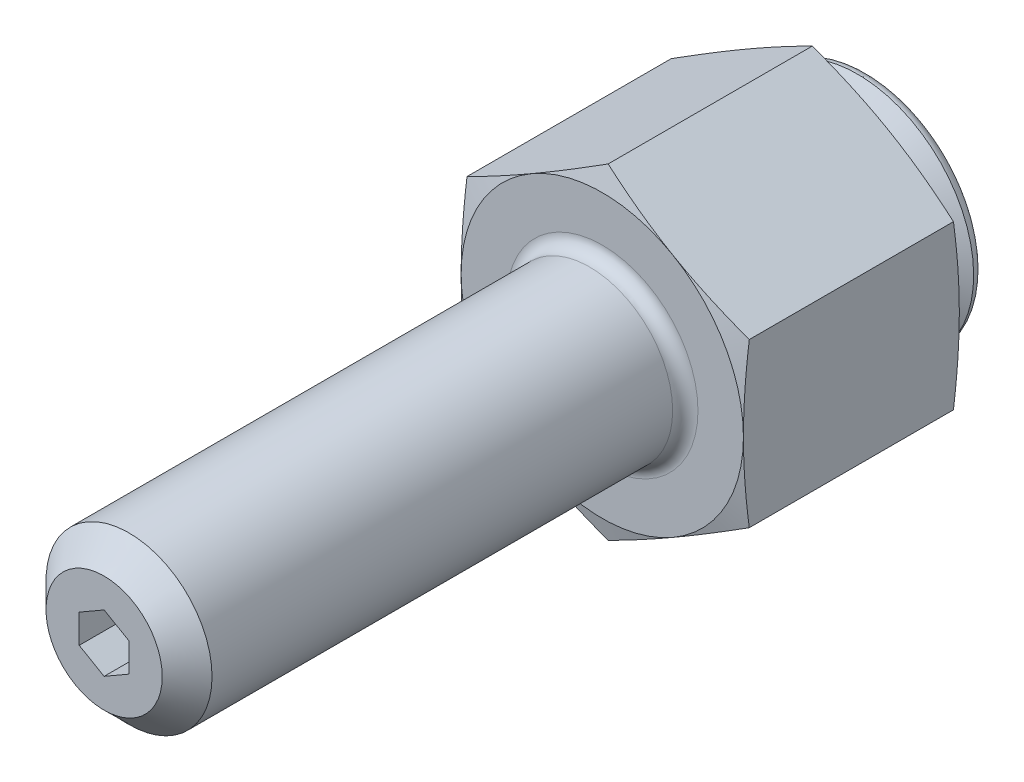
ISO-10303-21;
HEADER;
FILE_DESCRIPTION(('STEP AP214'),'2;1');
FILE_NAME('part.step','',(''),(''),'','','');
FILE_SCHEMA(('AUTOMOTIVE_DESIGN { 1 0 10303 214 1 1 1 1 }'));
ENDSEC;
DATA;
#1=APPLICATION_CONTEXT('core data for automotive mechanical design processes');
#2=APPLICATION_PROTOCOL_DEFINITION('international standard','automotive_design',2000,#1);
#3=PRODUCT_CONTEXT('',#1,'mechanical');
#4=PRODUCT('Part','Part','',(#3));
#5=PRODUCT_RELATED_PRODUCT_CATEGORY('part','',(#4));
#6=PRODUCT_DEFINITION_FORMATION('','',#4);
#7=PRODUCT_DEFINITION_CONTEXT('part definition',#1,'design');
#8=PRODUCT_DEFINITION('design','',#6,#7);
#9=PRODUCT_DEFINITION_SHAPE('','',#8);
#10=(LENGTH_UNIT() NAMED_UNIT(*) SI_UNIT(.MILLI.,.METRE.));
#11=(NAMED_UNIT(*) PLANE_ANGLE_UNIT() SI_UNIT($,.RADIAN.));
#12=(NAMED_UNIT(*) SI_UNIT($,.STERADIAN.) SOLID_ANGLE_UNIT());
#13=UNCERTAINTY_MEASURE_WITH_UNIT(LENGTH_MEASURE(1.E-05),#10,'distance_accuracy_value','');
#14=(GEOMETRIC_REPRESENTATION_CONTEXT(3) GLOBAL_UNCERTAINTY_ASSIGNED_CONTEXT((#13)) GLOBAL_UNIT_ASSIGNED_CONTEXT((#10,
#11,#12)) REPRESENTATION_CONTEXT('',''));
#15=CARTESIAN_POINT('',(0.,0.,0.));
#16=DIRECTION('',(0.,0.,1.));
#17=DIRECTION('',(1.,0.,0.));
#18=AXIS2_PLACEMENT_3D('',#15,#16,#17);
#19=CARTESIAN_POINT('',(0.,0.,6.3503999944));
#20=DIRECTION('',(0.,0.,-1.));
#21=DIRECTION('',(-0.279811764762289,0.96005488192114,0.));
#22=AXIS2_PLACEMENT_3D('',#19,#20,#21);
#23=SPHERICAL_SURFACE('',#22,6.5);
#24=CARTESIAN_POINT('',(0.,0.,4.0159999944));
#25=DIRECTION('',(0.,0.,-1.));
#26=DIRECTION('',(-0.96005488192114,-0.279811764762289,0.));
#27=AXIS2_PLACEMENT_3D('',#24,#25,#26);
#28=CIRCLE('',#27,6.06634788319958);
#29=CARTESIAN_POINT('',(-1.69743550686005,5.82402690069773,4.0159999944));
#30=VERTEX_POINT('',#29);
#31=EDGE_CURVE('E9',#30,#30,#28,.F.);
#32=CARTESIAN_POINT('',(0.,0.,2.88641592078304));
#33=DIRECTION('',(0.,0.,1.));
#34=DIRECTION('',(-0.279811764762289,0.96005488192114,0.));
#35=AXIS2_PLACEMENT_3D('',#32,#33,#34);
#36=CIRCLE('',#35,5.50007403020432);
#37=CARTESIAN_POINT('',(-1.5389854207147,5.28037292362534,2.88641592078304));
#38=VERTEX_POINT('',#37);
#39=EDGE_CURVE('E359',#38,#38,#36,.T.);
#40=CARTESIAN_POINT('',(-1.69743550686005,5.82402690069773,4.0159999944));
#41=CARTESIAN_POINT('',(-1.69611072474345,5.81948147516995,4.00369644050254));
#42=CARTESIAN_POINT('',(-1.69477546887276,5.81490011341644,3.99140729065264));
#43=CARTESIAN_POINT('',(-1.69208405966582,5.80566568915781,3.96685825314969));
#44=CARTESIAN_POINT('',(-1.69072790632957,5.80101262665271,3.95459836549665));
#45=CARTESIAN_POINT('',(-1.68799475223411,5.7916349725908,3.93010830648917));
#46=CARTESIAN_POINT('',(-1.6866177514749,5.786910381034,3.91787813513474));
#47=CARTESIAN_POINT('',(-1.68384295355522,5.77738984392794,3.89344796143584));
#48=CARTESIAN_POINT('',(-1.68244515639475,5.77259389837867,3.88124795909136));
#49=CARTESIAN_POINT('',(-1.67962881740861,5.76293083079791,3.85687857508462));
#50=CARTESIAN_POINT('',(-1.67821027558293,5.75806370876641,3.84470919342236));
#51=CARTESIAN_POINT('',(-1.67535249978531,5.74825846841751,3.82040150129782));
#52=CARTESIAN_POINT('',(-1.67391326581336,5.7433203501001,3.80826319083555));
#53=CARTESIAN_POINT('',(-1.67101415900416,5.73337329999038,3.78401809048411));
#54=CARTESIAN_POINT('',(-1.66955428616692,5.72836436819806,3.77191130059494));
#55=CARTESIAN_POINT('',(-1.66661395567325,5.71827587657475,3.74772968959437));
#56=CARTESIAN_POINT('',(-1.66513349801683,5.71319631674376,3.73565486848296));
#57=CARTESIAN_POINT('',(-1.66215205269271,5.70296675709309,3.71153764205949));
#58=CARTESIAN_POINT('',(-1.66065106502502,5.6978167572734,3.69949523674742));
#59=CARTESIAN_POINT('',(-1.65762861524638,5.68744650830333,3.67544328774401));
#60=CARTESIAN_POINT('',(-1.65610715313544,5.68222625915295,3.66343374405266));
#61=CARTESIAN_POINT('',(-1.65304381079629,5.6717157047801,3.63944796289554));
#62=CARTESIAN_POINT('',(-1.65150193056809,5.66642539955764,3.62747172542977));
#63=CARTESIAN_POINT('',(-1.6483978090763,5.65577492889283,3.60355300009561));
#64=CARTESIAN_POINT('',(-1.64683556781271,5.65041476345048,3.59161051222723));
#65=CARTESIAN_POINT('',(-1.64369078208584,5.63962477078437,3.56775972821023));
#66=CARTESIAN_POINT('',(-1.64210823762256,5.6341949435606,3.55585143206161));
#67=CARTESIAN_POINT('',(-1.63892290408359,5.62326582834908,3.53206947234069));
#68=CARTESIAN_POINT('',(-1.63732011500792,5.61776654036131,3.5201958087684));
#69=CARTESIAN_POINT('',(-1.63409435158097,5.60669870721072,3.49648355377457));
#70=CARTESIAN_POINT('',(-1.6324713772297,5.60113016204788,3.48464496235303));
#71=CARTESIAN_POINT('',(-1.62920530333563,5.58992402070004,3.46100328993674));
#72=CARTESIAN_POINT('',(-1.62756220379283,5.58428642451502,3.44920020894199));
#73=CARTESIAN_POINT('',(-1.62425594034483,5.57294238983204,3.42562999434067));
#74=CARTESIAN_POINT('',(-1.62259277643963,5.56723595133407,3.41386286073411));
#75=CARTESIAN_POINT('',(-1.61924644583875,5.55575444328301,3.39036497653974));
#76=CARTESIAN_POINT('',(-1.61756327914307,5.54997937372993,3.37863422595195));
#77=CARTESIAN_POINT('',(-1.61417700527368,5.53836081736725,3.35520954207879));
#78=CARTESIAN_POINT('',(-1.61247389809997,5.53251733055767,3.34351560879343));
#79=CARTESIAN_POINT('',(-1.60904780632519,5.5207621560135,3.32016499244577));
#80=CARTESIAN_POINT('',(-1.60732482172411,5.51485046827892,3.30850830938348));
#81=CARTESIAN_POINT('',(-1.60385903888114,5.50295911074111,3.28523262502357));
#82=CARTESIAN_POINT('',(-1.60211624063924,5.49697944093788,3.27361362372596));
#83=CARTESIAN_POINT('',(-1.59861089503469,5.48495234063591,3.25041373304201));
#84=CARTESIAN_POINT('',(-1.59684834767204,5.47890491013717,3.23883284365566));
#85=CARTESIAN_POINT('',(-1.59330356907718,5.46674251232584,3.2157096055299));
#86=CARTESIAN_POINT('',(-1.59152133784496,5.46062754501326,3.20416725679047));
#87=CARTESIAN_POINT('',(-1.5879372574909,5.44833029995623,3.18112152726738));
#88=CARTESIAN_POINT('',(-1.58613540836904,5.44214802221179,3.16961814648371));
#89=CARTESIAN_POINT('',(-1.58251215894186,5.42971638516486,3.14665077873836));
#90=CARTESIAN_POINT('',(-1.58069075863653,5.42346702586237,3.13518679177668));
#91=CARTESIAN_POINT('',(-1.57702847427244,5.41090145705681,3.112298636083));
#92=CARTESIAN_POINT('',(-1.57518759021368,5.40458524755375,3.100874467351));
#93=CARTESIAN_POINT('',(-1.57148640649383,5.39188621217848,3.07806637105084));
#94=CARTESIAN_POINT('',(-1.56962610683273,5.38550338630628,3.06668244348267));
#95=CARTESIAN_POINT('',(-1.56588616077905,5.37267135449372,3.04395525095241));
#96=CARTESIAN_POINT('',(-1.56400651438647,5.36622214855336,3.03261198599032));
#97=CARTESIAN_POINT('',(-1.56022794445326,5.35325759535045,3.00996653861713));
#98=CARTESIAN_POINT('',(-1.55832902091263,5.34674224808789,2.99866435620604));
#99=CARTESIAN_POINT('',(-1.55451196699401,5.33364565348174,2.97610149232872));
#100=CARTESIAN_POINT('',(-1.55259383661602,5.32706440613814,2.96484081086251));
#101=CARTESIAN_POINT('',(-1.54873843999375,5.31383625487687,2.94236136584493));
#102=CARTESIAN_POINT('',(-1.54680117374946,5.30718935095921,2.93114260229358));
#103=CARTESIAN_POINT('',(-1.5429075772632,5.29383013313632,2.90874740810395));
#104=CARTESIAN_POINT('',(-1.54095124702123,5.2871178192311,2.89757097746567));
#105=CARTESIAN_POINT('',(-1.5389854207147,5.28037292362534,2.88641592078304));
#106=B_SPLINE_CURVE_WITH_KNOTS('',3,(#40,#41,#42,#43,#44,#45,#46,#47,#48,#49,#50,#51,#52,#53,
#54,#55,#56,#57,#58,#59,#60,#61,#62,#63,#64,#65,#66,#67,#68,#69,#70,#71,#72,#73,#74,#75,#76,#77,
#78,#79,#80,#81,#82,#83,#84,#85,#86,#87,#88,#89,#90,#91,#92,#93,#94,#95,#96,#97,#98,#99,#100,
#101,#102,#103,#104,#105),.UNSPECIFIED.,.F.,.F.,(4,2,2,2,2,2,2,2,2,2,2,2,2,2,2,2,2,2,2,2,2,2,2,
2,2,2,2,2,2,2,2,2,4),(0.,0.0395491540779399,0.0790983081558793,0.118647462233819,
0.15819661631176,0.1977457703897,0.23729492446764,0.27684407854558,0.31639323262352,
0.35594238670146,0.3954915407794,0.43504069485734,0.47458984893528,0.51413900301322,
0.55368815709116,0.5932373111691,0.63278646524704,0.672335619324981,0.71188477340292,
0.751433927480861,0.7909830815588,0.83053223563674,0.87008138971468,0.90963054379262,
0.949179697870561,0.988728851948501,1.02827800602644,1.06782716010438,1.10737631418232,
1.14692546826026,1.1864746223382,1.22602377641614,1.26557293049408),.UNSPECIFIED.);
#107=EDGE_CURVE('BSEAM14',#30,#38,#106,.T.);
#108=ORIENTED_EDGE('',*,*,#31,.F.);
#109=ORIENTED_EDGE('',*,*,#39,.T.);
#110=ORIENTED_EDGE('',*,*,#107,.T.);
#111=ORIENTED_EDGE('',*,*,#107,.F.);
#112=EDGE_LOOP('',(#108,#110,#109,#111));
#113=FACE_BOUND('',#112,.T.);
#114=ADVANCED_FACE('F14',(#113),#23,.T.);
#115=CARTESIAN_POINT('',(0.,0.,0.));
#116=DIRECTION('',(0.,0.,-1.));
#117=DIRECTION('',(0.279811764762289,-0.96005488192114,0.));
#118=AXIS2_PLACEMENT_3D('',#115,#116,#117);
#119=CYLINDRICAL_SURFACE('',#118,5.461);
#120=CARTESIAN_POINT('',(0.,0.,2.75105408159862));
#121=DIRECTION('',(0.,0.,1.));
#122=DIRECTION('',(-0.279811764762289,0.96005488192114,0.));
#123=AXIS2_PLACEMENT_3D('',#120,#121,#122);
#124=CIRCLE('',#123,5.461);
#125=CARTESIAN_POINT('',(-1.52805204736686,5.24285971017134,2.75105408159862));
#126=VERTEX_POINT('',#125);
#127=EDGE_CURVE('E357',#126,#126,#124,.F.);
#128=ORIENTED_EDGE('',*,*,#127,.T.);
#129=EDGE_LOOP('',(#128));
#130=FACE_BOUND('',#129,.T.);
#131=CARTESIAN_POINT('',(0.,0.,1.670189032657));
#132=DIRECTION('',(0.,0.,-1.));
#133=DIRECTION('',(0.279811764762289,-0.96005488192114,0.));
#134=AXIS2_PLACEMENT_3D('',#131,#132,#133);
#135=CIRCLE('',#134,5.461);
#136=CARTESIAN_POINT('',(1.52805204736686,-5.24285971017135,1.670189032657));
#137=VERTEX_POINT('',#136);
#138=EDGE_CURVE('E354',#137,#137,#135,.F.);
#139=ORIENTED_EDGE('',*,*,#138,.T.);
#140=EDGE_LOOP('',(#139));
#141=FACE_BOUND('',#140,.T.);
#142=ADVANCED_FACE('F378',(#130,#141),#119,.T.);
#143=CARTESIAN_POINT('',(0.,0.,1.52354206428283));
#144=DIRECTION('',(0.,0.,-1.));
#145=DIRECTION('',(0.279811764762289,-0.96005488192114,0.));
#146=AXIS2_PLACEMENT_3D('',#143,#144,#145);
#147=CONICAL_SURFACE('',#146,5.461,1.0471975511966);
#148=CARTESIAN_POINT('',(0.,0.,1.45021858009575));
#149=DIRECTION('',(0.,0.,-1.));
#150=DIRECTION('',(0.279811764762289,-0.96005488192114,0.));
#151=AXIS2_PLACEMENT_3D('',#148,#149,#150);
#152=CIRCLE('',#151,5.588);
#153=CARTESIAN_POINT('',(1.56358814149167,-5.36478668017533,1.45021858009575));
#154=VERTEX_POINT('',#153);
#155=EDGE_CURVE('E18',#154,#154,#152,.T.);
#156=ORIENTED_EDGE('',*,*,#155,.T.);
#157=EDGE_LOOP('',(#156));
#158=FACE_BOUND('',#157,.T.);
#159=CARTESIAN_POINT('',(0.,0.,0.635));
#160=DIRECTION('',(0.,0.,-1.));
#161=DIRECTION('',(0.279811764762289,-0.96005488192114,0.));
#162=AXIS2_PLACEMENT_3D('',#159,#160,#161);
#163=CIRCLE('',#162,7.);
#164=CARTESIAN_POINT('',(1.95868235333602,-6.72038417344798,0.635));
#165=VERTEX_POINT('',#164);
#166=EDGE_CURVE('E348',#165,#165,#163,.T.);
#167=ORIENTED_EDGE('',*,*,#166,.F.);
#168=EDGE_LOOP('',(#167));
#169=FACE_BOUND('',#168,.T.);
#170=ADVANCED_FACE('F384',(#158,#169),#147,.T.);
#171=CARTESIAN_POINT('',(-1.95868235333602,6.72038417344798,0.));
#172=DIRECTION('',(0.,0.,1.));
#173=DIRECTION('',(-0.279811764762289,0.96005488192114,0.));
#174=AXIS2_PLACEMENT_3D('',#171,#172,#173);
#175=PLANE('',#174);
#176=CARTESIAN_POINT('',(0.,0.,0.));
#177=DIRECTION('',(0.,0.,1.));
#178=DIRECTION('',(-0.279811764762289,0.96005488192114,0.));
#179=AXIS2_PLACEMENT_3D('',#176,#177,#178);
#180=CIRCLE('',#179,6.365);
#181=CARTESIAN_POINT('',(-1.78100188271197,6.11074932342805,0.));
#182=VERTEX_POINT('',#181);
#183=EDGE_CURVE('E351',#182,#182,#180,.F.);
#184=ORIENTED_EDGE('',*,*,#183,.T.);
#185=EDGE_LOOP('',(#184));
#186=FACE_BOUND('',#185,.T.);
#187=ADVANCED_FACE('F444',(#186),#175,.F.);
#188=CARTESIAN_POINT('',(0.,0.,0.635));
#189=DIRECTION('',(0.,0.,1.));
#190=DIRECTION('',(-0.279811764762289,0.96005488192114,0.));
#191=AXIS2_PLACEMENT_3D('',#188,#189,#190);
#192=TOROIDAL_SURFACE('',#191,6.365,0.635);
#193=ORIENTED_EDGE('',*,*,#166,.T.);
#194=EDGE_LOOP('',(#193));
#195=FACE_BOUND('',#194,.T.);
#196=ORIENTED_EDGE('',*,*,#183,.F.);
#197=EDGE_LOOP('',(#196));
#198=FACE_BOUND('',#197,.T.);
#199=ADVANCED_FACE('F447',(#195,#198),#192,.T.);
#200=CARTESIAN_POINT('',(0.,0.,2.75105408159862));
#201=DIRECTION('',(0.,0.,1.));
#202=DIRECTION('',(-0.279811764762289,0.96005488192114,0.));
#203=AXIS2_PLACEMENT_3D('',#200,#201,#202);
#204=TOROIDAL_SURFACE('',#203,5.715,0.254);
#205=ORIENTED_EDGE('',*,*,#39,.F.);
#206=EDGE_LOOP('',(#205));
#207=FACE_BOUND('',#206,.T.);
#208=ORIENTED_EDGE('',*,*,#127,.F.);
#209=EDGE_LOOP('',(#208));
#210=FACE_BOUND('',#209,.T.);
#211=ADVANCED_FACE('F396',(#207,#210),#204,.F.);
#212=CARTESIAN_POINT('',(0.,0.,1.670189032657));
#213=DIRECTION('',(0.,0.,-1.));
#214=DIRECTION('',(0.279811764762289,-0.96005488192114,0.));
#215=AXIS2_PLACEMENT_3D('',#212,#213,#214);
#216=TOROIDAL_SURFACE('',#215,5.715,0.254);
#217=ORIENTED_EDGE('',*,*,#138,.F.);
#218=EDGE_LOOP('',(#217));
#219=FACE_BOUND('',#218,.T.);
#220=ORIENTED_EDGE('',*,*,#155,.F.);
#221=EDGE_LOOP('',(#220));
#222=FACE_BOUND('',#221,.T.);
#223=ADVANCED_FACE('F16',(#219,#222),#216,.F.);
#224=CARTESIAN_POINT('',(3.,0.,41.9999999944));
#225=DIRECTION('',(0.,0.,-1.));
#226=DIRECTION('',(-1.,0.,0.));
#227=AXIS2_PLACEMENT_3D('',#224,#225,#226);
#228=PLANE('',#227);
#229=DIRECTION('',(-0.866025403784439,0.5,0.));
#230=VECTOR('',#229,1.);
#231=CARTESIAN_POINT('',(1.5,0.866025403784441,41.9999999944));
#232=LINE('',#231,#230);
#233=CARTESIAN_POINT('',(1.5,0.866025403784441,41.9999999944));
#234=VERTEX_POINT('',#233);
#235=CARTESIAN_POINT('',(0.,1.73205080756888,41.9999999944));
#236=VERTEX_POINT('',#235);
#237=EDGE_CURVE('E144',#234,#236,#232,.T.);
#238=ORIENTED_EDGE('',*,*,#237,.T.);
#239=DIRECTION('',(-0.866025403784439,-0.5,0.));
#240=VECTOR('',#239,1.);
#241=CARTESIAN_POINT('',(0.,1.73205080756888,41.9999999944));
#242=LINE('',#241,#240);
#243=CARTESIAN_POINT('',(-1.5,0.866025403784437,41.9999999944));
#244=VERTEX_POINT('',#243);
#245=EDGE_CURVE('E153',#236,#244,#242,.T.);
#246=ORIENTED_EDGE('',*,*,#245,.T.);
#247=DIRECTION('',(0.,-1.,0.));
#248=VECTOR('',#247,1.);
#249=CARTESIAN_POINT('',(-1.5,0.866025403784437,41.9999999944));
#250=LINE('',#249,#248);
#251=CARTESIAN_POINT('',(-1.5,-0.86602540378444,41.9999999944));
#252=VERTEX_POINT('',#251);
#253=EDGE_CURVE('E158',#244,#252,#250,.T.);
#254=ORIENTED_EDGE('',*,*,#253,.T.);
#255=DIRECTION('',(0.866025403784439,-0.5,0.));
#256=VECTOR('',#255,1.);
#257=CARTESIAN_POINT('',(-1.5,-0.86602540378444,41.9999999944));
#258=LINE('',#257,#256);
#259=CARTESIAN_POINT('',(0.,-1.73205080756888,41.9999999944));
#260=VERTEX_POINT('',#259);
#261=EDGE_CURVE('E172',#252,#260,#258,.T.);
#262=ORIENTED_EDGE('',*,*,#261,.T.);
#263=DIRECTION('',(0.866025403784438,0.5,0.));
#264=VECTOR('',#263,1.);
#265=CARTESIAN_POINT('',(0.,-1.73205080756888,41.9999999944));
#266=LINE('',#265,#264);
#267=CARTESIAN_POINT('',(1.5,-0.866025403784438,41.9999999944));
#268=VERTEX_POINT('',#267);
#269=EDGE_CURVE('E175',#260,#268,#266,.T.);
#270=ORIENTED_EDGE('',*,*,#269,.T.);
#271=DIRECTION('',(0.,1.,0.));
#272=VECTOR('',#271,1.);
#273=CARTESIAN_POINT('',(1.5,-0.866025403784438,41.9999999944));
#274=LINE('',#273,#272);
#275=EDGE_CURVE('E150',#268,#234,#274,.T.);
#276=ORIENTED_EDGE('',*,*,#275,.T.);
#277=EDGE_LOOP('',(#238,#246,#254,#262,#270,#276));
#278=FACE_BOUND('',#277,.T.);
#279=ADVANCED_FACE('F160',(#278),#228,.F.);
#280=CARTESIAN_POINT('',(0.,1.73205080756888,41.9999999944));
#281=DIRECTION('',(-0.5,0.866025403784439,0.));
#282=DIRECTION('',(0.866025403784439,0.5,0.));
#283=AXIS2_PLACEMENT_3D('',#280,#281,#282);
#284=PLANE('',#283);
#285=DIRECTION('',(-0.866025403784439,-0.5,0.));
#286=VECTOR('',#285,1.);
#287=CARTESIAN_POINT('',(0.,1.73205080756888,45.9999999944));
#288=LINE('',#287,#286);
#289=CARTESIAN_POINT('',(0.,1.73205080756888,45.9999999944));
#290=VERTEX_POINT('',#289);
#291=CARTESIAN_POINT('',(-1.5,0.866025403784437,45.9999999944));
#292=VERTEX_POINT('',#291);
#293=EDGE_CURVE('E179',#290,#292,#288,.T.);
#294=ORIENTED_EDGE('',*,*,#293,.T.);
#295=DIRECTION('',(0.,0.,1.));
#296=VECTOR('',#295,1.);
#297=CARTESIAN_POINT('',(-1.5,0.866025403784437,41.9999999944));
#298=LINE('',#297,#296);
#299=EDGE_CURVE('E149',#244,#292,#298,.T.);
#300=ORIENTED_EDGE('',*,*,#299,.F.);
#301=ORIENTED_EDGE('',*,*,#245,.F.);
#302=DIRECTION('',(0.,0.,1.));
#303=VECTOR('',#302,1.);
#304=CARTESIAN_POINT('',(0.,1.73205080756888,41.9999999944));
#305=LINE('',#304,#303);
#306=EDGE_CURVE('E140',#236,#290,#305,.T.);
#307=ORIENTED_EDGE('',*,*,#306,.T.);
#308=EDGE_LOOP('',(#294,#300,#301,#307));
#309=FACE_BOUND('',#308,.T.);
#310=ADVANCED_FACE('F154',(#309),#284,.F.);
#311=CARTESIAN_POINT('',(-1.5,0.866025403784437,41.9999999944));
#312=DIRECTION('',(-1.,0.,0.));
#313=DIRECTION('',(0.,1.,0.));
#314=AXIS2_PLACEMENT_3D('',#311,#312,#313);
#315=PLANE('',#314);
#316=DIRECTION('',(0.,-1.,0.));
#317=VECTOR('',#316,1.);
#318=CARTESIAN_POINT('',(-1.5,0.866025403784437,45.9999999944));
#319=LINE('',#318,#317);
#320=CARTESIAN_POINT('',(-1.5,-0.866025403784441,45.9999999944));
#321=VERTEX_POINT('',#320);
#322=EDGE_CURVE('E181',#292,#321,#319,.T.);
#323=ORIENTED_EDGE('',*,*,#322,.T.);
#324=DIRECTION('',(0.,0.,1.));
#325=VECTOR('',#324,1.);
#326=CARTESIAN_POINT('',(-1.5,-0.86602540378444,41.9999999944));
#327=LINE('',#326,#325);
#328=EDGE_CURVE('E196',#252,#321,#327,.T.);
#329=ORIENTED_EDGE('',*,*,#328,.F.);
#330=ORIENTED_EDGE('',*,*,#253,.F.);
#331=ORIENTED_EDGE('',*,*,#299,.T.);
#332=EDGE_LOOP('',(#323,#329,#330,#331));
#333=FACE_BOUND('',#332,.T.);
#334=ADVANCED_FACE('F394',(#333),#315,.F.);
#335=CARTESIAN_POINT('',(-1.5,-0.86602540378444,41.9999999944));
#336=DIRECTION('',(-0.5,-0.866025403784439,0.));
#337=DIRECTION('',(-0.866025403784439,0.5,0.));
#338=AXIS2_PLACEMENT_3D('',#335,#336,#337);
#339=PLANE('',#338);
#340=DIRECTION('',(0.866025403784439,-0.5,0.));
#341=VECTOR('',#340,1.);
#342=CARTESIAN_POINT('',(-1.5,-0.866025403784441,45.9999999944));
#343=LINE('',#342,#341);
#344=CARTESIAN_POINT('',(0.,-1.73205080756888,45.9999999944));
#345=VERTEX_POINT('',#344);
#346=EDGE_CURVE('E184',#321,#345,#343,.T.);
#347=ORIENTED_EDGE('',*,*,#346,.T.);
#348=DIRECTION('',(0.,0.,1.));
#349=VECTOR('',#348,1.);
#350=CARTESIAN_POINT('',(0.,-1.73205080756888,41.9999999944));
#351=LINE('',#350,#349);
#352=EDGE_CURVE('E194',#260,#345,#351,.T.);
#353=ORIENTED_EDGE('',*,*,#352,.F.);
#354=ORIENTED_EDGE('',*,*,#261,.F.);
#355=ORIENTED_EDGE('',*,*,#328,.T.);
#356=EDGE_LOOP('',(#347,#353,#354,#355));
#357=FACE_BOUND('',#356,.T.);
#358=ADVANCED_FACE('F406',(#357),#339,.F.);
#359=CARTESIAN_POINT('',(0.,-1.73205080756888,41.9999999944));
#360=DIRECTION('',(0.5,-0.866025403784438,0.));
#361=DIRECTION('',(-0.866025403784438,-0.5,0.));
#362=AXIS2_PLACEMENT_3D('',#359,#360,#361);
#363=PLANE('',#362);
#364=DIRECTION('',(0.866025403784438,0.5,0.));
#365=VECTOR('',#364,1.);
#366=CARTESIAN_POINT('',(0.,-1.73205080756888,45.9999999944));
#367=LINE('',#366,#365);
#368=CARTESIAN_POINT('',(1.5,-0.866025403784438,45.9999999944));
#369=VERTEX_POINT('',#368);
#370=EDGE_CURVE('E166',#345,#369,#367,.T.);
#371=ORIENTED_EDGE('',*,*,#370,.T.);
#372=DIRECTION('',(0.,0.,1.));
#373=VECTOR('',#372,1.);
#374=CARTESIAN_POINT('',(1.5,-0.866025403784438,41.9999999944));
#375=LINE('',#374,#373);
#376=EDGE_CURVE('E192',#268,#369,#375,.T.);
#377=ORIENTED_EDGE('',*,*,#376,.F.);
#378=ORIENTED_EDGE('',*,*,#269,.F.);
#379=ORIENTED_EDGE('',*,*,#352,.T.);
#380=EDGE_LOOP('',(#371,#377,#378,#379));
#381=FACE_BOUND('',#380,.T.);
#382=ADVANCED_FACE('F402',(#381),#363,.F.);
#383=CARTESIAN_POINT('',(1.5,-0.866025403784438,41.9999999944));
#384=DIRECTION('',(1.,0.,0.));
#385=DIRECTION('',(0.,-1.,0.));
#386=AXIS2_PLACEMENT_3D('',#383,#384,#385);
#387=PLANE('',#386);
#388=DIRECTION('',(0.,1.,0.));
#389=VECTOR('',#388,1.);
#390=CARTESIAN_POINT('',(1.5,-0.866025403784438,45.9999999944));
#391=LINE('',#390,#389);
#392=CARTESIAN_POINT('',(1.5,0.866025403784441,45.9999999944));
#393=VERTEX_POINT('',#392);
#394=EDGE_CURVE('E163',#369,#393,#391,.T.);
#395=ORIENTED_EDGE('',*,*,#394,.T.);
#396=DIRECTION('',(0.,0.,1.));
#397=VECTOR('',#396,1.);
#398=CARTESIAN_POINT('',(1.5,0.866025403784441,41.9999999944));
#399=LINE('',#398,#397);
#400=EDGE_CURVE('E189',#234,#393,#399,.T.);
#401=ORIENTED_EDGE('',*,*,#400,.F.);
#402=ORIENTED_EDGE('',*,*,#275,.F.);
#403=ORIENTED_EDGE('',*,*,#376,.T.);
#404=EDGE_LOOP('',(#395,#401,#402,#403));
#405=FACE_BOUND('',#404,.T.);
#406=ADVANCED_FACE('F399',(#405),#387,.F.);
#407=CARTESIAN_POINT('',(1.5,0.866025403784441,41.9999999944));
#408=DIRECTION('',(0.5,0.866025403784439,0.));
#409=DIRECTION('',(0.866025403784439,-0.5,0.));
#410=AXIS2_PLACEMENT_3D('',#407,#408,#409);
#411=PLANE('',#410);
#412=DIRECTION('',(-0.866025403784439,0.5,0.));
#413=VECTOR('',#412,1.);
#414=CARTESIAN_POINT('',(1.5,0.866025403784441,45.9999999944));
#415=LINE('',#414,#413);
#416=EDGE_CURVE('E31',#393,#290,#415,.T.);
#417=ORIENTED_EDGE('',*,*,#416,.T.);
#418=ORIENTED_EDGE('',*,*,#306,.F.);
#419=ORIENTED_EDGE('',*,*,#237,.F.);
#420=ORIENTED_EDGE('',*,*,#400,.T.);
#421=EDGE_LOOP('',(#417,#418,#419,#420));
#422=FACE_BOUND('',#421,.T.);
#423=ADVANCED_FACE('F142',(#422),#411,.F.);
#424=CARTESIAN_POINT('',(0.,0.,45.9999999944));
#425=DIRECTION('',(0.,0.,1.));
#426=DIRECTION('',(1.,0.,0.));
#427=AXIS2_PLACEMENT_3D('',#424,#425,#426);
#428=PLANE('',#427);
#429=ORIENTED_EDGE('',*,*,#416,.F.);
#430=ORIENTED_EDGE('',*,*,#394,.F.);
#431=ORIENTED_EDGE('',*,*,#370,.F.);
#432=ORIENTED_EDGE('',*,*,#346,.F.);
#433=ORIENTED_EDGE('',*,*,#322,.F.);
#434=ORIENTED_EDGE('',*,*,#293,.F.);
#435=EDGE_LOOP('',(#429,#430,#431,#432,#433,#434));
#436=FACE_BOUND('',#435,.T.);
#437=CARTESIAN_POINT('',(0.,0.,45.9999999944));
#438=DIRECTION('',(0.,0.,1.));
#439=DIRECTION('',(1.,0.,0.));
#440=AXIS2_PLACEMENT_3D('',#437,#438,#439);
#441=CIRCLE('',#440,3.5);
#442=CARTESIAN_POINT('',(3.5,0.,45.9999999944));
#443=VERTEX_POINT('',#442);
#444=EDGE_CURVE('E343',#443,#443,#441,.T.);
#445=ORIENTED_EDGE('',*,*,#444,.T.);
#446=EDGE_LOOP('',(#445));
#447=FACE_BOUND('',#446,.T.);
#448=ADVANCED_FACE('F416',(#436,#447),#428,.T.);
#449=CARTESIAN_POINT('',(0.,0.,45.9999999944));
#450=DIRECTION('',(0.,0.,-1.));
#451=DIRECTION('',(-1.,0.,0.));
#452=AXIS2_PLACEMENT_3D('',#449,#450,#451);
#453=CONICAL_SURFACE('',#452,3.5,0.785398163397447);
#454=CARTESIAN_POINT('',(0.,0.,44.4999999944));
#455=DIRECTION('',(0.,0.,1.));
#456=DIRECTION('',(1.,0.,0.));
#457=AXIS2_PLACEMENT_3D('',#454,#455,#456);
#458=CIRCLE('',#457,5.);
#459=CARTESIAN_POINT('',(5.,0.,44.4999999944));
#460=VERTEX_POINT('',#459);
#461=EDGE_CURVE('E23',#460,#460,#458,.F.);
#462=ORIENTED_EDGE('',*,*,#461,.F.);
#463=EDGE_LOOP('',(#462));
#464=FACE_BOUND('',#463,.T.);
#465=ORIENTED_EDGE('',*,*,#444,.F.);
#466=EDGE_LOOP('',(#465));
#467=FACE_BOUND('',#466,.T.);
#468=ADVANCED_FACE('F418',(#464,#467),#453,.T.);
#469=CARTESIAN_POINT('',(0.,0.,45.9999999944));
#470=DIRECTION('',(0.,0.,-1.));
#471=DIRECTION('',(-1.,0.,0.));
#472=AXIS2_PLACEMENT_3D('',#469,#470,#471);
#473=CYLINDRICAL_SURFACE('',#472,5.);
#474=ORIENTED_EDGE('',*,*,#461,.T.);
#475=EDGE_LOOP('',(#474));
#476=FACE_BOUND('',#475,.T.);
#477=CARTESIAN_POINT('',(0.,0.,16.7619999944));
#478=DIRECTION('',(0.,0.,1.));
#479=DIRECTION('',(1.,0.,0.));
#480=AXIS2_PLACEMENT_3D('',#477,#478,#479);
#481=CIRCLE('',#480,5.);
#482=CARTESIAN_POINT('',(5.,0.,16.7619999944));
#483=VERTEX_POINT('',#482);
#484=EDGE_CURVE('E337',#483,#483,#481,.T.);
#485=ORIENTED_EDGE('',*,*,#484,.T.);
#486=EDGE_LOOP('',(#485));
#487=FACE_BOUND('',#486,.T.);
#488=ADVANCED_FACE('F420',(#476,#487),#473,.T.);
#489=CARTESIAN_POINT('',(0.,0.,16.7619999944));
#490=DIRECTION('',(0.,0.,1.));
#491=DIRECTION('',(1.,0.,0.));
#492=AXIS2_PLACEMENT_3D('',#489,#490,#491);
#493=TOROIDAL_SURFACE('',#492,5.762,0.762);
#494=CARTESIAN_POINT('',(0.,0.,15.9999999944));
#495=DIRECTION('',(0.,0.,1.));
#496=DIRECTION('',(1.,0.,0.));
#497=AXIS2_PLACEMENT_3D('',#494,#495,#496);
#498=CIRCLE('',#497,5.762);
#499=CARTESIAN_POINT('',(5.762,0.,15.9999999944));
#500=VERTEX_POINT('',#499);
#501=EDGE_CURVE('E340',#500,#500,#498,.F.);
#502=ORIENTED_EDGE('',*,*,#501,.F.);
#503=EDGE_LOOP('',(#502));
#504=FACE_BOUND('',#503,.T.);
#505=ORIENTED_EDGE('',*,*,#484,.F.);
#506=EDGE_LOOP('',(#505));
#507=FACE_BOUND('',#506,.T.);
#508=ADVANCED_FACE('F422',(#504,#507),#493,.F.);
#509=CARTESIAN_POINT('',(-8.5,-14.7224318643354,15.9999999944));
#510=DIRECTION('',(0.,0.,1.));
#511=DIRECTION('',(1.,0.,0.));
#512=AXIS2_PLACEMENT_3D('',#509,#510,#511);
#513=PLANE('',#512);
#514=CARTESIAN_POINT('',(0.,0.,15.9999999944));
#515=DIRECTION('',(0.,0.,1.));
#516=DIRECTION('',(1.,0.,0.));
#517=AXIS2_PLACEMENT_3D('',#514,#515,#516);
#518=CIRCLE('',#517,8.5);
#519=CARTESIAN_POINT('',(4.25,-7.36121593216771,15.9999999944));
#520=VERTEX_POINT('',#519);
#521=CARTESIAN_POINT('',(8.5,0.,15.9999999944));
#522=VERTEX_POINT('',#521);
#523=EDGE_CURVE('E306',#520,#522,#518,.T.);
#524=ORIENTED_EDGE('',*,*,#523,.T.);
#525=CARTESIAN_POINT('',(4.25,7.36121593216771,15.9999999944));
#526=VERTEX_POINT('',#525);
#527=EDGE_CURVE('E325',#522,#526,#518,.T.);
#528=ORIENTED_EDGE('',*,*,#527,.T.);
#529=CARTESIAN_POINT('',(-4.25,7.36121593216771,15.9999999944));
#530=VERTEX_POINT('',#529);
#531=EDGE_CURVE('E824',#526,#530,#518,.T.);
#532=ORIENTED_EDGE('',*,*,#531,.T.);
#533=CARTESIAN_POINT('',(0.,0.,15.9999999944));
#534=DIRECTION('',(0.,0.,-1.));
#535=DIRECTION('',(-1.,0.,0.));
#536=AXIS2_PLACEMENT_3D('',#533,#534,#535);
#537=CIRCLE('',#536,8.5);
#538=CARTESIAN_POINT('',(-8.5,0.,15.9999999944));
#539=VERTEX_POINT('',#538);
#540=EDGE_CURVE('E788',#539,#530,#537,.T.);
#541=ORIENTED_EDGE('',*,*,#540,.F.);
#542=CARTESIAN_POINT('',(-4.25,-7.36121593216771,15.9999999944));
#543=VERTEX_POINT('',#542);
#544=EDGE_CURVE('E826',#539,#543,#518,.T.);
#545=ORIENTED_EDGE('',*,*,#544,.T.);
#546=EDGE_CURVE('E324',#543,#520,#518,.T.);
#547=ORIENTED_EDGE('',*,*,#546,.T.);
#548=EDGE_LOOP('',(#524,#528,#532,#541,#545,#547));
#549=FACE_BOUND('',#548,.T.);
#550=ORIENTED_EDGE('',*,*,#501,.T.);
#551=EDGE_LOOP('',(#550));
#552=FACE_BOUND('',#551,.T.);
#553=ADVANCED_FACE('F428',(#549,#552),#513,.T.);
#554=CARTESIAN_POINT('',(0.,0.,14.5858363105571));
#555=DIRECTION('',(0.,0.,-1.));
#556=DIRECTION('',(-1.,0.,0.));
#557=AXIS2_PLACEMENT_3D('',#554,#555,#556);
#558=CONICAL_SURFACE('',#557,13.7777307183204,1.30899693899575);
#559=ORIENTED_EDGE('',*,*,#540,.T.);
#560=CARTESIAN_POINT('',(-8.5002,4.90736181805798,15.6476280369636));
#561=CARTESIAN_POINT('',(-8.14719977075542,5.11116659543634,15.7022599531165));
#562=CARTESIAN_POINT('',(-7.7935595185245,5.31534089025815,15.7518566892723));
#563=CARTESIAN_POINT('',(-7.08503012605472,5.72441052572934,15.8389934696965));
#564=CARTESIAN_POINT('',(-6.73014053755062,5.92930612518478,15.8765286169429));
#565=CARTESIAN_POINT('',(-6.02126413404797,6.33857610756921,15.9373509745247));
#566=CARTESIAN_POINT('',(-5.66728211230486,6.54294772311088,15.9607107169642));
#567=CARTESIAN_POINT('',(-4.95886665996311,6.95195157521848,15.9920337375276));
#568=CARTESIAN_POINT('',(-4.60443332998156,7.15658375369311,15.9999999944));
#569=CARTESIAN_POINT('',(-3.89556667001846,7.56584811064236,15.9999999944));
#570=CARTESIAN_POINT('',(-3.54113334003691,7.77048028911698,15.9920337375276));
#571=CARTESIAN_POINT('',(-2.83271788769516,8.17948414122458,15.9607107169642));
#572=CARTESIAN_POINT('',(-2.47873586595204,8.38385575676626,15.9373509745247));
#573=CARTESIAN_POINT('',(-1.76985946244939,8.79312573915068,15.8765286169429));
#574=CARTESIAN_POINT('',(-1.41496987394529,8.99802133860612,15.8389934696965));
#575=CARTESIAN_POINT('',(-0.706440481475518,9.40709097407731,15.7518566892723));
#576=CARTESIAN_POINT('',(-0.352800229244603,9.61126526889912,15.7022599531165));
#577=CARTESIAN_POINT('',(0.00019999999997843,9.81507004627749,15.6476280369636));
#578=B_SPLINE_CURVE_WITH_KNOTS('',3,(#560,#561,#562,#563,#564,#565,#566,#567,#568,#569,#570,
#571,#572,#573,#574,#575,#576,#577),.UNSPECIFIED.,.F.,.F.,(4,2,2,2,2,2,2,2,4),(0.,
1.23382789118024,2.46815608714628,3.69611406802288,4.92383440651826,6.15155474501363,
7.37951272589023,8.61384092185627,9.84766881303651),.UNSPECIFIED.);
#579=CARTESIAN_POINT('',(-8.5,4.90747728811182,15.6476589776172));
#580=VERTEX_POINT('',#579);
#581=EDGE_CURVE('E776',#580,#530,#578,.T.);
#582=ORIENTED_EDGE('',*,*,#581,.F.);
#583=CARTESIAN_POINT('',(-8.5,-13.0512816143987,14.1042136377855));
#584=CARTESIAN_POINT('',(-8.5,-12.6648584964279,14.1909538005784));
#585=CARTESIAN_POINT('',(-8.49999999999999,-12.2781955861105,14.2766446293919));
#586=CARTESIAN_POINT('',(-8.49999999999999,-11.5042722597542,14.4453610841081));
#587=CARTESIAN_POINT('',(-8.49999999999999,-11.117011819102,14.5283865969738));
#588=CARTESIAN_POINT('',(-8.49999999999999,-10.3414386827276,14.6912760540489));
#589=CARTESIAN_POINT('',(-8.5,-9.95312533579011,14.7711369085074));
#590=CARTESIAN_POINT('',(-8.5,-9.17569540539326,14.9268461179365));
#591=CARTESIAN_POINT('',(-8.5,-8.7865788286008,15.0026945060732));
#592=CARTESIAN_POINT('',(-8.5,-8.01051094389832,15.1488360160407));
#593=CARTESIAN_POINT('',(-8.5,-7.62356710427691,15.2191686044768));
#594=CARTESIAN_POINT('',(-8.5,-6.8486278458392,15.3537690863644));
#595=CARTESIAN_POINT('',(-8.5,-6.46063245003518,15.418037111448));
#596=CARTESIAN_POINT('',(-8.5,-5.68350619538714,15.5390761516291));
#597=CARTESIAN_POINT('',(-8.5,-5.29437546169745,15.595847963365));
#598=CARTESIAN_POINT('',(-8.5,-4.51487354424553,15.7002342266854));
#599=CARTESIAN_POINT('',(-8.5,-4.12450235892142,15.7478486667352));
#600=CARTESIAN_POINT('',(-8.5,-3.33808456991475,15.8325873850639));
#601=CARTESIAN_POINT('',(-8.5,-2.94202415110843,15.8695853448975));
#602=CARTESIAN_POINT('',(-8.5,-2.14889276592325,15.9305478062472));
#603=CARTESIAN_POINT('',(-8.5,-1.75182182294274,15.9545126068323));
#604=CARTESIAN_POINT('',(-8.5,-0.957247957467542,15.9880119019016));
#605=CARTESIAN_POINT('',(-8.5,-0.559745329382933,15.9975532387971));
#606=CARTESIAN_POINT('',(-8.5,0.235337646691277,16.0016174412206));
#607=CARTESIAN_POINT('',(-8.5,0.632917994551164,15.996140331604));
#608=CARTESIAN_POINT('',(-8.5,1.42906314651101,15.9704744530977));
#609=CARTESIAN_POINT('',(-8.50000000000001,1.82762616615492,15.9502314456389));
#610=CARTESIAN_POINT('',(-8.50000000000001,2.62382411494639,15.8961949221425));
#611=CARTESIAN_POINT('',(-8.50000000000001,3.0214590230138,15.862401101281));
#612=CARTESIAN_POINT('',(-8.50000000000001,3.8157965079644,15.7829870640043));
#613=CARTESIAN_POINT('',(-8.50000000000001,4.21249828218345,15.7373589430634));
#614=CARTESIAN_POINT('',(-8.50000000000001,5.0046222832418,15.6361961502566));
#615=CARTESIAN_POINT('',(-8.5,5.40004450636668,15.5806614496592));
#616=CARTESIAN_POINT('',(-8.5,6.17208279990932,15.4641342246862));
#617=CARTESIAN_POINT('',(-8.50000000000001,6.54875266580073,15.4034945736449));
#618=CARTESIAN_POINT('',(-8.50000000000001,7.30107458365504,15.2761707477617));
#619=CARTESIAN_POINT('',(-8.50000000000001,7.67672660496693,15.2094863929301));
#620=CARTESIAN_POINT('',(-8.50000000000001,8.42716271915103,15.0712017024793));
#621=CARTESIAN_POINT('',(-8.50000000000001,8.80194671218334,14.9996008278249));
#622=CARTESIAN_POINT('',(-8.50000000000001,9.55072369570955,14.8524099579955));
#623=CARTESIAN_POINT('',(-8.50000000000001,9.9247166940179,14.7768200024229));
#624=CARTESIAN_POINT('',(-8.50000000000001,10.6721291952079,14.6223666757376));
#625=CARTESIAN_POINT('',(-8.50000000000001,11.0455485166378,14.5435024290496));
#626=CARTESIAN_POINT('',(-8.50000000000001,11.7918134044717,14.3831005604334));
#627=CARTESIAN_POINT('',(-8.50000000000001,12.1646589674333,14.3015629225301));
#628=CARTESIAN_POINT('',(-8.50000000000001,13.2824122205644,14.0536763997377));
#629=CARTESIAN_POINT('',(-8.50000000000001,14.0265910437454,13.8840424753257));
#630=CARTESIAN_POINT('',(-8.50000000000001,15.5060345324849,13.5404485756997));
#631=CARTESIAN_POINT('',(-8.50000000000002,16.2413134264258,13.3665494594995));
#632=CARTESIAN_POINT('',(-8.50000000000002,17.7108552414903,13.0144541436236));
#633=CARTESIAN_POINT('',(-8.50000000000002,18.4451181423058,12.8362578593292));
#634=CARTESIAN_POINT('',(-8.50000000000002,19.9119106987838,12.4769434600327));
#635=CARTESIAN_POINT('',(-8.50000000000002,20.6444413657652,12.2958294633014));
#636=CARTESIAN_POINT('',(-8.50000000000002,22.1088735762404,11.9311804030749));
#637=CARTESIAN_POINT('',(-8.50000000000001,22.8407751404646,11.7476454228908));
#638=CARTESIAN_POINT('',(-8.5,23.5724592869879,11.5632573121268));
#639=B_SPLINE_CURVE_WITH_KNOTS('',3,(#583,#584,#585,#586,#587,#588,#589,#590,#591,#592,#593,
#594,#595,#596,#597,#598,#599,#600,#601,#602,#603,#604,#605,#606,#607,#608,#609,#610,#611,#612,
#613,#614,#615,#616,#617,#618,#619,#620,#621,#622,#623,#624,#625,#626,#627,#628,#629,#630,#631,
#632,#633,#634,#635,#636,#637,#638),.UNSPECIFIED.,.F.,.F.,(4,2,2,2,2,2,2,2,2,2,2,2,2,2,2,2,2,2,
2,2,2,2,2,2,2,2,2,4),(0.,1.18812096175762,2.37629224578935,3.56559634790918,4.75489061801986,
5.93470372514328,7.1144912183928,8.29415323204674,9.47381673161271,10.6669836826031,
11.8601232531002,13.0526966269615,14.2452680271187,15.4422422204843,16.6392433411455,
17.8370460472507,19.0348522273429,20.1793528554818,21.3238875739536,22.4685479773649,
23.6131970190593,24.758154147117,25.9031181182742,28.1928788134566,30.4595538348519,
32.7262735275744,34.9900339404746,37.2537166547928),.UNSPECIFIED.);
#640=EDGE_CURVE('E761',#539,#580,#639,.T.);
#641=ORIENTED_EDGE('',*,*,#640,.F.);
#642=EDGE_LOOP('',(#559,#582,#641));
#643=FACE_BOUND('',#642,.T.);
#644=ADVANCED_FACE('F551',(#643),#558,.T.);
#645=ORIENTED_EDGE('',*,*,#544,.F.);
#646=CARTESIAN_POINT('',(-8.5,-4.90747728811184,15.6476589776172));
#647=VERTEX_POINT('',#646);
#648=EDGE_CURVE('E768',#647,#539,#639,.T.);
#649=ORIENTED_EDGE('',*,*,#648,.F.);
#650=CARTESIAN_POINT('',(0.000199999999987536,-9.81507004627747,15.6476280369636));
#651=CARTESIAN_POINT('',(-0.352800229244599,-9.61126526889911,15.7022599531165));
#652=CARTESIAN_POINT('',(-0.706440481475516,-9.40709097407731,15.7518566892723));
#653=CARTESIAN_POINT('',(-1.41496987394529,-8.99802133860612,15.8389934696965));
#654=CARTESIAN_POINT('',(-1.76985946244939,-8.79312573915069,15.8765286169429));
#655=CARTESIAN_POINT('',(-2.47873586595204,-8.38385575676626,15.9373509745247));
#656=CARTESIAN_POINT('',(-2.83271788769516,-8.17948414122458,15.9607107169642));
#657=CARTESIAN_POINT('',(-3.54113334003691,-7.77048028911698,15.9920337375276));
#658=CARTESIAN_POINT('',(-3.89556667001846,-7.56584811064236,15.9999999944));
#659=CARTESIAN_POINT('',(-4.60443332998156,-7.15658375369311,15.9999999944));
#660=CARTESIAN_POINT('',(-4.95886665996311,-6.95195157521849,15.9920337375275));
#661=CARTESIAN_POINT('',(-5.66728211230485,-6.54294772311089,15.9607107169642));
#662=CARTESIAN_POINT('',(-6.02126413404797,-6.33857610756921,15.9373509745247));
#663=CARTESIAN_POINT('',(-6.73014053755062,-5.92930612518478,15.8765286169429));
#664=CARTESIAN_POINT('',(-7.08503012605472,-5.72441052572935,15.8389934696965));
#665=CARTESIAN_POINT('',(-7.79355951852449,-5.31534089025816,15.7518566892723));
#666=CARTESIAN_POINT('',(-8.14719977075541,-5.11116659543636,15.7022599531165));
#667=CARTESIAN_POINT('',(-8.5002,-4.907361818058,15.6476280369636));
#668=B_SPLINE_CURVE_WITH_KNOTS('',3,(#650,#651,#652,#653,#654,#655,#656,#657,#658,#659,#660,
#661,#662,#663,#664,#665,#666,#667),.UNSPECIFIED.,.F.,.F.,(4,2,2,2,2,2,2,2,4),(0.,
1.23382789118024,2.46815608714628,3.69611406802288,4.92383440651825,6.15155474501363,
7.37951272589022,8.61384092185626,9.8476688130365),.UNSPECIFIED.);
#669=EDGE_CURVE('E279',#543,#647,#668,.T.);
#670=ORIENTED_EDGE('',*,*,#669,.F.);
#671=EDGE_LOOP('',(#645,#649,#670));
#672=FACE_BOUND('',#671,.T.);
#673=ADVANCED_FACE('F560',(#672),#558,.T.);
#674=ORIENTED_EDGE('',*,*,#546,.F.);
#675=CARTESIAN_POINT('',(0.,-9.81495457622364,15.6476589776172));
#676=VERTEX_POINT('',#675);
#677=EDGE_CURVE('E287',#676,#543,#668,.T.);
#678=ORIENTED_EDGE('',*,*,#677,.F.);
#679=CARTESIAN_POINT('',(8.5002,-4.90736181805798,15.6476280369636));
#680=CARTESIAN_POINT('',(8.14719977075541,-5.11116659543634,15.7022599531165));
#681=CARTESIAN_POINT('',(7.7935595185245,-5.31534089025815,15.7518566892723));
#682=CARTESIAN_POINT('',(7.08503012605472,-5.72441052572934,15.8389934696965));
#683=CARTESIAN_POINT('',(6.73014053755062,-5.92930612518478,15.8765286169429));
#684=CARTESIAN_POINT('',(6.02126413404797,-6.33857610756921,15.9373509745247));
#685=CARTESIAN_POINT('',(5.66728211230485,-6.54294772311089,15.9607107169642));
#686=CARTESIAN_POINT('',(4.9588666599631,-6.95195157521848,15.9920337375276));
#687=CARTESIAN_POINT('',(4.60443332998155,-7.15658375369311,15.9999999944));
#688=CARTESIAN_POINT('',(3.89556667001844,-7.56584811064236,15.9999999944));
#689=CARTESIAN_POINT('',(3.54113334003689,-7.77048028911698,15.9920337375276));
#690=CARTESIAN_POINT('',(2.83271788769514,-8.17948414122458,15.9607107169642));
#691=CARTESIAN_POINT('',(2.47873586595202,-8.38385575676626,15.9373509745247));
#692=CARTESIAN_POINT('',(1.76985946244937,-8.79312573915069,15.8765286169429));
#693=CARTESIAN_POINT('',(1.41496987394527,-8.99802133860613,15.8389934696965));
#694=CARTESIAN_POINT('',(0.706440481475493,-9.40709097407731,15.7518566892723));
#695=CARTESIAN_POINT('',(0.352800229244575,-9.61126526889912,15.7022599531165));
#696=CARTESIAN_POINT('',(-0.00020000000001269,-9.81507004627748,15.6476280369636));
#697=B_SPLINE_CURVE_WITH_KNOTS('',3,(#679,#680,#681,#682,#683,#684,#685,#686,#687,#688,#689,
#690,#691,#692,#693,#694,#695,#696),.UNSPECIFIED.,.F.,.F.,(4,2,2,2,2,2,2,2,4),(0.,
1.23382789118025,2.46815608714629,3.69611406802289,4.92383440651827,6.15155474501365,
7.37951272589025,8.61384092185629,9.84766881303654),.UNSPECIFIED.);
#698=EDGE_CURVE('E294',#520,#676,#697,.T.);
#699=ORIENTED_EDGE('',*,*,#698,.F.);
#700=EDGE_LOOP('',(#674,#678,#699));
#701=FACE_BOUND('',#700,.T.);
#702=ADVANCED_FACE('F570',(#701),#558,.T.);
#703=CARTESIAN_POINT('',(8.5,-13.0512816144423,14.1042136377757));
#704=CARTESIAN_POINT('',(8.50000000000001,-12.6648584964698,14.1909538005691));
#705=CARTESIAN_POINT('',(8.50000000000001,-12.2781955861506,14.2766446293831));
#706=CARTESIAN_POINT('',(8.50000000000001,-11.5042722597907,14.4453610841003));
#707=CARTESIAN_POINT('',(8.50000000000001,-11.1170118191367,14.5283865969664));
#708=CARTESIAN_POINT('',(8.50000000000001,-10.3414386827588,14.6912760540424));
#709=CARTESIAN_POINT('',(8.50000000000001,-9.95312533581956,14.7711369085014));
#710=CARTESIAN_POINT('',(8.50000000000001,-9.17569540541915,14.9268461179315));
#711=CARTESIAN_POINT('',(8.50000000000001,-8.78657882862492,15.0026945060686));
#712=CARTESIAN_POINT('',(8.50000000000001,-8.01051094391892,15.1488360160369));
#713=CARTESIAN_POINT('',(8.50000000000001,-7.62356710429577,15.2191686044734));
#714=CARTESIAN_POINT('',(8.50000000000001,-6.84862784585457,15.3537690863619));
#715=CARTESIAN_POINT('',(8.50000000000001,-6.46063245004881,15.4180371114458));
#716=CARTESIAN_POINT('',(8.50000000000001,-5.68350619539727,15.5390761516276));
#717=CARTESIAN_POINT('',(8.50000000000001,-5.29437546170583,15.5958479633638));
#718=CARTESIAN_POINT('',(8.50000000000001,-4.51487354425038,15.7002342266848));
#719=CARTESIAN_POINT('',(8.5,-4.1245023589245,15.7478486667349));
#720=CARTESIAN_POINT('',(8.5,-3.3380845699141,15.832587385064));
#721=CARTESIAN_POINT('',(8.5,-2.94202415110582,15.8695853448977));
#722=CARTESIAN_POINT('',(8.50000000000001,-2.1488927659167,15.9305478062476));
#723=CARTESIAN_POINT('',(8.50000000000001,-1.75182182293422,15.9545126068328));
#724=CARTESIAN_POINT('',(8.50000000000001,-0.95724795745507,15.988011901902));
#725=CARTESIAN_POINT('',(8.5,-0.559745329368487,15.9975532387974));
#726=CARTESIAN_POINT('',(8.5,0.235337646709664,16.0016174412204));
#727=CARTESIAN_POINT('',(8.5,0.632917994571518,15.9961403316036));
#728=CARTESIAN_POINT('',(8.5,1.4290631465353,15.9704744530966));
#729=CARTESIAN_POINT('',(8.5,1.82762616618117,15.9502314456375));
#730=CARTESIAN_POINT('',(8.5,2.62382411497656,15.8961949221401));
#731=CARTESIAN_POINT('',(8.5,3.02145902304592,15.8624011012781));
#732=CARTESIAN_POINT('',(8.5,3.81579650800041,15.7829870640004));
#733=CARTESIAN_POINT('',(8.5,4.21249828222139,15.7373589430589));
#734=CARTESIAN_POINT('',(8.5,5.0046222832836,15.636196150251));
#735=CARTESIAN_POINT('',(8.5,5.40004450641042,15.580661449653));
#736=CARTESIAN_POINT('',(8.5,6.17208279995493,15.464134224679));
#737=CARTESIAN_POINT('',(8.5,6.54875266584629,15.4034945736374));
#738=CARTESIAN_POINT('',(8.5,7.30107458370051,15.2761707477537));
#739=CARTESIAN_POINT('',(8.5,7.67672660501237,15.209486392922));
#740=CARTESIAN_POINT('',(8.5,8.42716271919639,15.0712017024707));
#741=CARTESIAN_POINT('',(8.5,8.80194671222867,14.9996008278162));
#742=CARTESIAN_POINT('',(8.5,9.55072369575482,14.8524099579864));
#743=CARTESIAN_POINT('',(8.5,9.92471669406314,14.7768200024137));
#744=CARTESIAN_POINT('',(8.5,10.6721291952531,14.6223666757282));
#745=CARTESIAN_POINT('',(8.49999999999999,11.0455485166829,14.54350242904));
#746=CARTESIAN_POINT('',(8.49999999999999,11.7918134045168,14.3831005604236));
#747=CARTESIAN_POINT('',(8.49999999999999,12.1646589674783,14.3015629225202));
#748=CARTESIAN_POINT('',(8.49999999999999,13.2824122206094,14.0536763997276));
#749=CARTESIAN_POINT('',(8.49999999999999,14.0265910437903,13.8840424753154));
#750=CARTESIAN_POINT('',(8.49999999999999,15.5060345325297,13.5404485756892));
#751=CARTESIAN_POINT('',(8.49999999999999,16.2413134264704,13.3665494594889));
#752=CARTESIAN_POINT('',(8.49999999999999,17.7108552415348,13.0144541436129));
#753=CARTESIAN_POINT('',(8.49999999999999,18.4451181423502,12.8362578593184));
#754=CARTESIAN_POINT('',(8.49999999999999,19.911910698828,12.4769434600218));
#755=CARTESIAN_POINT('',(8.49999999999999,20.6444413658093,12.2958294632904));
#756=CARTESIAN_POINT('',(8.49999999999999,22.1088735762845,11.9311804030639));
#757=CARTESIAN_POINT('',(8.49999999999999,22.8407751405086,11.7476454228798));
#758=CARTESIAN_POINT('',(8.5,23.5724592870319,11.5632573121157));
#759=B_SPLINE_CURVE_WITH_KNOTS('',3,(#703,#704,#705,#706,#707,#708,#709,#710,#711,#712,#713,
#714,#715,#716,#717,#718,#719,#720,#721,#722,#723,#724,#725,#726,#727,#728,#729,#730,#731,#732,
#733,#734,#735,#736,#737,#738,#739,#740,#741,#742,#743,#744,#745,#746,#747,#748,#749,#750,#751,
#752,#753,#754,#755,#756,#757,#758),.UNSPECIFIED.,.F.,.F.,(4,2,2,2,2,2,2,2,2,2,2,2,2,2,2,2,2,2,
2,2,2,2,2,2,2,2,2,4),(0.,1.18812096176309,2.3762922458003,3.56559634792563,4.7548906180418,
5.93470372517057,7.11449121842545,8.29415323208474,9.47381673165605,10.6669836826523,
11.8601232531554,13.0526966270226,14.2452680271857,15.4422422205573,16.6392433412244,
17.8370460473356,19.0348522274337,20.1793528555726,21.3238875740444,22.4685479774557,
23.6131970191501,24.7581541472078,25.903118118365,28.1928788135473,30.4595538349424,
32.7262735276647,34.9900339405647,37.2537166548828),.UNSPECIFIED.);
#760=CARTESIAN_POINT('',(8.5,-4.90747728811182,15.6476589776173));
#761=VERTEX_POINT('',#760);
#762=EDGE_CURVE('E302',#522,#761,#759,.F.);
#763=ORIENTED_EDGE('',*,*,#762,.F.);
#764=ORIENTED_EDGE('',*,*,#523,.F.);
#765=EDGE_CURVE('E301',#761,#520,#697,.T.);
#766=ORIENTED_EDGE('',*,*,#765,.F.);
#767=EDGE_LOOP('',(#763,#764,#766));
#768=FACE_BOUND('',#767,.T.);
#769=ADVANCED_FACE('F579',(#768),#558,.T.);
#770=CARTESIAN_POINT('',(-0.000200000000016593,9.81507004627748,15.6476280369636));
#771=CARTESIAN_POINT('',(0.352800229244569,9.61126526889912,15.7022599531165));
#772=CARTESIAN_POINT('',(0.706440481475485,9.40709097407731,15.7518566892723));
#773=CARTESIAN_POINT('',(1.41496987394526,8.99802133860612,15.8389934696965));
#774=CARTESIAN_POINT('',(1.76985946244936,8.79312573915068,15.8765286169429));
#775=CARTESIAN_POINT('',(2.47873586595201,8.38385575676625,15.9373509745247));
#776=CARTESIAN_POINT('',(2.83271788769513,8.17948414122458,15.9607107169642));
#777=CARTESIAN_POINT('',(3.54113334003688,7.77048028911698,15.9920337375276));
#778=CARTESIAN_POINT('',(3.89556667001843,7.56584811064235,15.9999999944));
#779=CARTESIAN_POINT('',(4.60443332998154,7.1565837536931,15.9999999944));
#780=CARTESIAN_POINT('',(4.95886665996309,6.95195157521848,15.9920337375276));
#781=CARTESIAN_POINT('',(5.66728211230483,6.54294772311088,15.9607107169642));
#782=CARTESIAN_POINT('',(6.02126413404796,6.3385761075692,15.9373509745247));
#783=CARTESIAN_POINT('',(6.7301405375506,5.92930612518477,15.8765286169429));
#784=CARTESIAN_POINT('',(7.08503012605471,5.72441052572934,15.8389934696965));
#785=CARTESIAN_POINT('',(7.79355951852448,5.31534089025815,15.7518566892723));
#786=CARTESIAN_POINT('',(8.1471997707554,5.11116659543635,15.7022599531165));
#787=CARTESIAN_POINT('',(8.5002,4.907361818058,15.6476280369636));
#788=B_SPLINE_CURVE_WITH_KNOTS('',3,(#770,#771,#772,#773,#774,#775,#776,#777,#778,#779,#780,
#781,#782,#783,#784,#785,#786,#787),.UNSPECIFIED.,.F.,.F.,(4,2,2,2,2,2,2,2,4),(0.,
1.23382789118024,2.46815608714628,3.69611406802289,4.92383440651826,6.15155474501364,
7.37951272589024,8.61384092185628,9.84766881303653),.UNSPECIFIED.);
#789=CARTESIAN_POINT('',(8.5,4.90747728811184,15.6476589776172));
#790=VERTEX_POINT('',#789);
#791=EDGE_CURVE('E777',#526,#790,#788,.T.);
#792=ORIENTED_EDGE('',*,*,#791,.F.);
#793=ORIENTED_EDGE('',*,*,#527,.F.);
#794=EDGE_CURVE('E288',#790,#522,#759,.F.);
#795=ORIENTED_EDGE('',*,*,#794,.F.);
#796=EDGE_LOOP('',(#792,#793,#795));
#797=FACE_BOUND('',#796,.T.);
#798=ADVANCED_FACE('F562',(#797),#558,.T.);
#799=CARTESIAN_POINT('',(0.,9.81495457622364,15.6476589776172));
#800=VERTEX_POINT('',#799);
#801=EDGE_CURVE('E778',#530,#800,#578,.T.);
#802=ORIENTED_EDGE('',*,*,#801,.F.);
#803=ORIENTED_EDGE('',*,*,#531,.F.);
#804=EDGE_CURVE('E769',#800,#526,#788,.T.);
#805=ORIENTED_EDGE('',*,*,#804,.F.);
#806=EDGE_LOOP('',(#802,#803,#805));
#807=FACE_BOUND('',#806,.T.);
#808=ADVANCED_FACE('F230',(#807),#558,.T.);
#809=CARTESIAN_POINT('',(-8.5,4.90747728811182,15.9999999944));
#810=DIRECTION('',(-0.5,0.866025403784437,0.));
#811=DIRECTION('',(0.866025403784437,0.5,0.));
#812=AXIS2_PLACEMENT_3D('',#809,#810,#811);
#813=PLANE('',#812);
#814=DIRECTION('',(0.,0.,-1.));
#815=VECTOR('',#814,1.);
#816=CARTESIAN_POINT('',(0.,9.81495457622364,15.9999999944));
#817=LINE('',#816,#815);
#818=CARTESIAN_POINT('',(0.,9.81495457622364,3.35234101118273));
#819=VERTEX_POINT('',#818);
#820=EDGE_CURVE('E316',#800,#819,#817,.T.);
#821=ORIENTED_EDGE('',*,*,#820,.T.);
#822=CARTESIAN_POINT('',(0.000199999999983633,9.81507004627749,3.3523719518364));
#823=CARTESIAN_POINT('',(-0.352800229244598,9.61126526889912,3.29774003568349));
#824=CARTESIAN_POINT('',(-0.706440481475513,9.40709097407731,3.24814329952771));
#825=CARTESIAN_POINT('',(-1.41496987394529,8.99802133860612,3.16100651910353));
#826=CARTESIAN_POINT('',(-1.76985946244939,8.79312573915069,3.12347137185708));
#827=CARTESIAN_POINT('',(-2.47873586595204,8.38385575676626,3.06264901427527));
#828=CARTESIAN_POINT('',(-2.83271788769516,8.17948414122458,3.03928927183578));
#829=CARTESIAN_POINT('',(-3.5411333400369,7.77048028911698,3.00796625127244));
#830=CARTESIAN_POINT('',(-3.89556667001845,7.56584811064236,2.9999999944));
#831=CARTESIAN_POINT('',(-4.60443332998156,7.15658375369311,2.9999999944));
#832=CARTESIAN_POINT('',(-4.95886665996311,6.95195157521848,3.00796625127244));
#833=CARTESIAN_POINT('',(-5.66728211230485,6.54294772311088,3.03928927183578));
#834=CARTESIAN_POINT('',(-6.02126413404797,6.33857610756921,3.06264901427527));
#835=CARTESIAN_POINT('',(-6.73014053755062,5.92930612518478,3.12347137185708));
#836=CARTESIAN_POINT('',(-7.08503012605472,5.72441052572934,3.16100651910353));
#837=CARTESIAN_POINT('',(-7.7935595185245,5.31534089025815,3.24814329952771));
#838=CARTESIAN_POINT('',(-8.14719977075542,5.11116659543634,3.29774003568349));
#839=CARTESIAN_POINT('',(-8.5002,4.90736181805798,3.3523719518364));
#840=B_SPLINE_CURVE_WITH_KNOTS('',3,(#822,#823,#824,#825,#826,#827,#828,#829,#830,#831,#832,
#833,#834,#835,#836,#837,#838,#839),.UNSPECIFIED.,.F.,.F.,(4,2,2,2,2,2,2,2,4),(0.,
1.23382789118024,2.46815608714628,3.69611406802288,4.92383440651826,6.15155474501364,
7.37951272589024,8.61384092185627,9.84766881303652),.UNSPECIFIED.);
#841=CARTESIAN_POINT('',(-4.25,7.36121593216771,2.9999999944));
#842=VERTEX_POINT('',#841);
#843=EDGE_CURVE('E210',#819,#842,#840,.T.);
#844=ORIENTED_EDGE('',*,*,#843,.T.);
#845=CARTESIAN_POINT('',(-8.5,4.90747728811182,3.35234101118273));
#846=VERTEX_POINT('',#845);
#847=EDGE_CURVE('E201',#842,#846,#840,.T.);
#848=ORIENTED_EDGE('',*,*,#847,.T.);
#849=DIRECTION('',(0.,0.,-1.));
#850=VECTOR('',#849,1.);
#851=CARTESIAN_POINT('',(-8.5,4.90747728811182,15.9999999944));
#852=LINE('',#851,#850);
#853=EDGE_CURVE('E319',#580,#846,#852,.T.);
#854=ORIENTED_EDGE('',*,*,#853,.F.);
#855=ORIENTED_EDGE('',*,*,#581,.T.);
#856=ORIENTED_EDGE('',*,*,#801,.T.);
#857=EDGE_LOOP('',(#821,#844,#848,#854,#855,#856));
#858=FACE_BOUND('',#857,.T.);
#859=ADVANCED_FACE('F217',(#858),#813,.T.);
#860=CARTESIAN_POINT('',(-8.5,-4.90747728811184,15.9999999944));
#861=DIRECTION('',(-1.,0.,0.));
#862=DIRECTION('',(0.,1.,0.));
#863=AXIS2_PLACEMENT_3D('',#860,#861,#862);
#864=PLANE('',#863);
#865=ORIENTED_EDGE('',*,*,#853,.T.);
#866=CARTESIAN_POINT('',(-8.5,-13.0512816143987,4.8957863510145));
#867=CARTESIAN_POINT('',(-8.49999999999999,-12.6648584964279,4.80904618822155));
#868=CARTESIAN_POINT('',(-8.49999999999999,-12.2781955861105,4.72335535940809));
#869=CARTESIAN_POINT('',(-8.49999999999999,-11.5042722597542,4.55463890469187));
#870=CARTESIAN_POINT('',(-8.49999999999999,-11.117011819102,4.47161339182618));
#871=CARTESIAN_POINT('',(-8.49999999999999,-10.3414386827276,4.30872393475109));
#872=CARTESIAN_POINT('',(-8.49999999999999,-9.95312533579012,4.22886308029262));
#873=CARTESIAN_POINT('',(-8.49999999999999,-9.17569540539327,4.07315387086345));
#874=CARTESIAN_POINT('',(-8.5,-8.78657882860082,3.99730548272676));
#875=CARTESIAN_POINT('',(-8.5,-8.01051094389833,3.85116397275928));
#876=CARTESIAN_POINT('',(-8.5,-7.62356710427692,3.78083138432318));
#877=CARTESIAN_POINT('',(-8.5,-6.84862784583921,3.64623090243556));
#878=CARTESIAN_POINT('',(-8.5,-6.46063245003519,3.58196287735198));
#879=CARTESIAN_POINT('',(-8.5,-5.68350619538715,3.46092383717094));
#880=CARTESIAN_POINT('',(-8.5,-5.29437546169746,3.40415202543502));
#881=CARTESIAN_POINT('',(-8.5,-4.51487354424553,3.29976576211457));
#882=CARTESIAN_POINT('',(-8.5,-4.12450235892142,3.25215132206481));
#883=CARTESIAN_POINT('',(-8.5,-3.33808456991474,3.16741260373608));
#884=CARTESIAN_POINT('',(-8.5,-2.94202415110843,3.13041464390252));
#885=CARTESIAN_POINT('',(-8.5,-2.14889276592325,3.06945218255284));
#886=CARTESIAN_POINT('',(-8.5,-1.75182182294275,3.04548738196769));
#887=CARTESIAN_POINT('',(-8.5,-0.957247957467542,3.01198808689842));
#888=CARTESIAN_POINT('',(-8.5,-0.559745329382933,3.00244675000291));
#889=CARTESIAN_POINT('',(-8.5,0.235337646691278,2.99838254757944));
#890=CARTESIAN_POINT('',(-8.5,0.632917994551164,3.00385965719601));
#891=CARTESIAN_POINT('',(-8.5,1.42906314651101,3.02952553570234));
#892=CARTESIAN_POINT('',(-8.5,1.82762616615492,3.04976854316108));
#893=CARTESIAN_POINT('',(-8.5,2.62382411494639,3.1038050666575));
#894=CARTESIAN_POINT('',(-8.50000000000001,3.02145902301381,3.13759888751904));
#895=CARTESIAN_POINT('',(-8.50000000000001,3.8157965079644,3.21701292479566));
#896=CARTESIAN_POINT('',(-8.50000000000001,4.21249828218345,3.26264104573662));
#897=CARTESIAN_POINT('',(-8.5,5.0046222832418,3.36380383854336));
#898=CARTESIAN_POINT('',(-8.5,5.40004450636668,3.41933853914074));
#899=CARTESIAN_POINT('',(-8.5,6.17208279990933,3.5358657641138));
#900=CARTESIAN_POINT('',(-8.50000000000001,6.54875266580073,3.59650541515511));
#901=CARTESIAN_POINT('',(-8.50000000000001,7.30107458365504,3.72382924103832));
#902=CARTESIAN_POINT('',(-8.50000000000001,7.67672660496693,3.79051359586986));
#903=CARTESIAN_POINT('',(-8.50000000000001,8.42716271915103,3.92879828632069));
#904=CARTESIAN_POINT('',(-8.50000000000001,8.80194671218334,4.00039916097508));
#905=CARTESIAN_POINT('',(-8.50000000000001,9.55072369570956,4.1475900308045));
#906=CARTESIAN_POINT('',(-8.50000000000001,9.9247166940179,4.22317998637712));
#907=CARTESIAN_POINT('',(-8.50000000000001,10.6721291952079,4.37763331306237));
#908=CARTESIAN_POINT('',(-8.50000000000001,11.0455485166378,4.45649755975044));
#909=CARTESIAN_POINT('',(-8.50000000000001,11.7918134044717,4.61689942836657));
#910=CARTESIAN_POINT('',(-8.50000000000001,12.1646589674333,4.69843706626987));
#911=CARTESIAN_POINT('',(-8.50000000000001,13.2824122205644,4.94632358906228));
#912=CARTESIAN_POINT('',(-8.50000000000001,14.0265910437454,5.11595751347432));
#913=CARTESIAN_POINT('',(-8.50000000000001,15.5060345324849,5.45955141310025));
#914=CARTESIAN_POINT('',(-8.50000000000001,16.2413134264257,5.63345052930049));
#915=CARTESIAN_POINT('',(-8.50000000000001,17.7108552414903,5.98554584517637));
#916=CARTESIAN_POINT('',(-8.50000000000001,18.4451181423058,6.16374212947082));
#917=CARTESIAN_POINT('',(-8.50000000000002,19.9119106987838,6.52305652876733));
#918=CARTESIAN_POINT('',(-8.50000000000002,20.6444413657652,6.70417052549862));
#919=CARTESIAN_POINT('',(-8.50000000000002,22.1088735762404,7.06881958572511));
#920=CARTESIAN_POINT('',(-8.50000000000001,22.8407751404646,7.25235456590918));
#921=CARTESIAN_POINT('',(-8.5,23.5724592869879,7.43674267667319));
#922=B_SPLINE_CURVE_WITH_KNOTS('',3,(#866,#867,#868,#869,#870,#871,#872,#873,#874,#875,#876,
#877,#878,#879,#880,#881,#882,#883,#884,#885,#886,#887,#888,#889,#890,#891,#892,#893,#894,#895,
#896,#897,#898,#899,#900,#901,#902,#903,#904,#905,#906,#907,#908,#909,#910,#911,#912,#913,#914,
#915,#916,#917,#918,#919,#920,#921),.UNSPECIFIED.,.F.,.F.,(4,2,2,2,2,2,2,2,2,2,2,2,2,2,2,2,2,2,
2,2,2,2,2,2,2,2,2,4),(0.,1.18812096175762,2.37629224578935,3.56559634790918,4.75489061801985,
5.93470372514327,7.1144912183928,8.29415323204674,9.4738167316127,10.6669836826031,
11.8601232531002,13.0526966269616,14.2452680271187,15.4422422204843,16.6392433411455,
17.8370460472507,19.0348522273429,20.1793528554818,21.3238875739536,22.4685479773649,
23.6131970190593,24.758154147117,25.9031181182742,28.1928788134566,30.4595538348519,
32.7262735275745,34.9900339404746,37.2537166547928),.UNSPECIFIED.);
#923=CARTESIAN_POINT('',(-8.5,0.,2.9999999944));
#924=VERTEX_POINT('',#923);
#925=EDGE_CURVE('E790',#846,#924,#922,.F.);
#926=ORIENTED_EDGE('',*,*,#925,.T.);
#927=CARTESIAN_POINT('',(-8.5,-4.90747728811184,3.35234101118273));
#928=VERTEX_POINT('',#927);
#929=EDGE_CURVE('E262',#924,#928,#922,.F.);
#930=ORIENTED_EDGE('',*,*,#929,.T.);
#931=DIRECTION('',(0.,0.,-1.));
#932=VECTOR('',#931,1.);
#933=CARTESIAN_POINT('',(-8.5,-4.90747728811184,15.9999999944));
#934=LINE('',#933,#932);
#935=EDGE_CURVE('E303',#647,#928,#934,.T.);
#936=ORIENTED_EDGE('',*,*,#935,.F.);
#937=ORIENTED_EDGE('',*,*,#648,.T.);
#938=ORIENTED_EDGE('',*,*,#640,.T.);
#939=EDGE_LOOP('',(#865,#926,#930,#936,#937,#938));
#940=FACE_BOUND('',#939,.T.);
#941=ADVANCED_FACE('F273',(#940),#864,.T.);
#942=CARTESIAN_POINT('',(0.,-9.81495457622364,15.9999999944));
#943=DIRECTION('',(-0.5,-0.866025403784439,0.));
#944=DIRECTION('',(-0.866025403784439,0.5,0.));
#945=AXIS2_PLACEMENT_3D('',#942,#943,#944);
#946=PLANE('',#945);
#947=ORIENTED_EDGE('',*,*,#935,.T.);
#948=CARTESIAN_POINT('',(-8.5002,-4.907361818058,3.3523719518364));
#949=CARTESIAN_POINT('',(-8.14719977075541,-5.11116659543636,3.29774003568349));
#950=CARTESIAN_POINT('',(-7.79355951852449,-5.31534089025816,3.24814329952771));
#951=CARTESIAN_POINT('',(-7.08503012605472,-5.72441052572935,3.16100651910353));
#952=CARTESIAN_POINT('',(-6.73014053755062,-5.92930612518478,3.12347137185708));
#953=CARTESIAN_POINT('',(-6.02126413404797,-6.33857610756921,3.06264901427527));
#954=CARTESIAN_POINT('',(-5.66728211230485,-6.54294772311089,3.03928927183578));
#955=CARTESIAN_POINT('',(-4.95886665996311,-6.95195157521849,3.00796625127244));
#956=CARTESIAN_POINT('',(-4.60443332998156,-7.15658375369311,2.9999999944));
#957=CARTESIAN_POINT('',(-3.89556667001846,-7.56584811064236,2.9999999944));
#958=CARTESIAN_POINT('',(-3.54113334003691,-7.77048028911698,3.00796625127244));
#959=CARTESIAN_POINT('',(-2.83271788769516,-8.17948414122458,3.03928927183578));
#960=CARTESIAN_POINT('',(-2.47873586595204,-8.38385575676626,3.06264901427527));
#961=CARTESIAN_POINT('',(-1.76985946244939,-8.79312573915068,3.12347137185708));
#962=CARTESIAN_POINT('',(-1.41496987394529,-8.99802133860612,3.16100651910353));
#963=CARTESIAN_POINT('',(-0.706440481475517,-9.40709097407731,3.24814329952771));
#964=CARTESIAN_POINT('',(-0.3528002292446,-9.61126526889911,3.29774003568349));
#965=CARTESIAN_POINT('',(0.000199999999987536,-9.81507004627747,3.3523719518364));
#966=B_SPLINE_CURVE_WITH_KNOTS('',3,(#948,#949,#950,#951,#952,#953,#954,#955,#956,#957,#958,
#959,#960,#961,#962,#963,#964,#965),.UNSPECIFIED.,.F.,.F.,(4,2,2,2,2,2,2,2,4),(0.,
1.23382789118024,2.46815608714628,3.69611406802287,4.92383440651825,6.15155474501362,
7.37951272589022,8.61384092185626,9.8476688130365),.UNSPECIFIED.);
#967=CARTESIAN_POINT('',(-4.25,-7.36121593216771,2.9999999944));
#968=VERTEX_POINT('',#967);
#969=EDGE_CURVE('E260',#928,#968,#966,.T.);
#970=ORIENTED_EDGE('',*,*,#969,.T.);
#971=CARTESIAN_POINT('',(0.,-9.81495457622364,3.35234101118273));
#972=VERTEX_POINT('',#971);
#973=EDGE_CURVE('E253',#968,#972,#966,.T.);
#974=ORIENTED_EDGE('',*,*,#973,.T.);
#975=DIRECTION('',(0.,0.,-1.));
#976=VECTOR('',#975,1.);
#977=CARTESIAN_POINT('',(0.,-9.81495457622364,15.9999999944));
#978=LINE('',#977,#976);
#979=EDGE_CURVE('E307',#676,#972,#978,.T.);
#980=ORIENTED_EDGE('',*,*,#979,.F.);
#981=ORIENTED_EDGE('',*,*,#677,.T.);
#982=ORIENTED_EDGE('',*,*,#669,.T.);
#983=EDGE_LOOP('',(#947,#970,#974,#980,#981,#982));
#984=FACE_BOUND('',#983,.T.);
#985=ADVANCED_FACE('F268',(#984),#946,.T.);
#986=CARTESIAN_POINT('',(8.5,-4.90747728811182,15.9999999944));
#987=DIRECTION('',(0.5,-0.866025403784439,0.));
#988=DIRECTION('',(-0.866025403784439,-0.5,0.));
#989=AXIS2_PLACEMENT_3D('',#986,#987,#988);
#990=PLANE('',#989);
#991=ORIENTED_EDGE('',*,*,#979,.T.);
#992=CARTESIAN_POINT('',(-0.00020000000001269,-9.81507004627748,3.3523719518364));
#993=CARTESIAN_POINT('',(0.352800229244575,-9.61126526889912,3.29774003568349));
#994=CARTESIAN_POINT('',(0.706440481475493,-9.40709097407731,3.24814329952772));
#995=CARTESIAN_POINT('',(1.41496987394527,-8.99802133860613,3.16100651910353));
#996=CARTESIAN_POINT('',(1.76985946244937,-8.79312573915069,3.12347137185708));
#997=CARTESIAN_POINT('',(2.47873586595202,-8.38385575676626,3.06264901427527));
#998=CARTESIAN_POINT('',(2.83271788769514,-8.17948414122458,3.03928927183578));
#999=CARTESIAN_POINT('',(3.54113334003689,-7.77048028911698,3.00796625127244));
#1000=CARTESIAN_POINT('',(3.89556667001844,-7.56584811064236,2.9999999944));
#1001=CARTESIAN_POINT('',(4.60443332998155,-7.15658375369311,2.9999999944));
#1002=CARTESIAN_POINT('',(4.9588666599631,-6.95195157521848,3.00796625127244));
#1003=CARTESIAN_POINT('',(5.66728211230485,-6.54294772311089,3.03928927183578));
#1004=CARTESIAN_POINT('',(6.02126413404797,-6.33857610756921,3.06264901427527));
#1005=CARTESIAN_POINT('',(6.73014053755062,-5.92930612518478,3.12347137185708));
#1006=CARTESIAN_POINT('',(7.08503012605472,-5.72441052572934,3.16100651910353));
#1007=CARTESIAN_POINT('',(7.7935595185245,-5.31534089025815,3.24814329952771));
#1008=CARTESIAN_POINT('',(8.14719977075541,-5.11116659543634,3.29774003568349));
#1009=CARTESIAN_POINT('',(8.5002,-4.90736181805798,3.3523719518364));
#1010=B_SPLINE_CURVE_WITH_KNOTS('',3,(#992,#993,#994,#995,#996,#997,#998,#999,#1000,#1001,#1002,
#1003,#1004,#1005,#1006,#1007,#1008,#1009),.UNSPECIFIED.,.F.,.F.,(4,2,2,2,2,2,2,2,4),(0.,
1.23382789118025,2.46815608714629,3.69611406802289,4.92383440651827,6.15155474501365,
7.37951272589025,8.61384092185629,9.84766881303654),.UNSPECIFIED.);
#1011=CARTESIAN_POINT('',(4.25,-7.36121593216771,2.9999999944));
#1012=VERTEX_POINT('',#1011);
#1013=EDGE_CURVE('E261',#972,#1012,#1010,.T.);
#1014=ORIENTED_EDGE('',*,*,#1013,.T.);
#1015=CARTESIAN_POINT('',(8.5,-4.90747728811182,3.35234101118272));
#1016=VERTEX_POINT('',#1015);
#1017=EDGE_CURVE('E246',#1012,#1016,#1010,.T.);
#1018=ORIENTED_EDGE('',*,*,#1017,.T.);
#1019=DIRECTION('',(0.,0.,-1.));
#1020=VECTOR('',#1019,1.);
#1021=CARTESIAN_POINT('',(8.5,-4.90747728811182,15.9999999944));
#1022=LINE('',#1021,#1020);
#1023=EDGE_CURVE('E310',#761,#1016,#1022,.T.);
#1024=ORIENTED_EDGE('',*,*,#1023,.F.);
#1025=ORIENTED_EDGE('',*,*,#765,.T.);
#1026=ORIENTED_EDGE('',*,*,#698,.T.);
#1027=EDGE_LOOP('',(#991,#1014,#1018,#1024,#1025,#1026));
#1028=FACE_BOUND('',#1027,.T.);
#1029=ADVANCED_FACE('F272',(#1028),#990,.T.);
#1030=CARTESIAN_POINT('',(8.5,4.90747728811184,15.9999999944));
#1031=DIRECTION('',(1.,0.,0.));
#1032=DIRECTION('',(0.,-1.,0.));
#1033=AXIS2_PLACEMENT_3D('',#1030,#1031,#1032);
#1034=PLANE('',#1033);
#1035=ORIENTED_EDGE('',*,*,#1023,.T.);
#1036=CARTESIAN_POINT('',(8.5,-13.0512816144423,4.89578635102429));
#1037=CARTESIAN_POINT('',(8.50000000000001,-12.6648584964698,4.80904618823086));
#1038=CARTESIAN_POINT('',(8.50000000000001,-12.2781955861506,4.72335535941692));
#1039=CARTESIAN_POINT('',(8.50000000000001,-11.5042722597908,4.55463890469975));
#1040=CARTESIAN_POINT('',(8.50000000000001,-11.1170118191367,4.47161339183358));
#1041=CARTESIAN_POINT('',(8.50000000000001,-10.3414386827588,4.30872393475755));
#1042=CARTESIAN_POINT('',(8.50000000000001,-9.95312533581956,4.22886308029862));
#1043=CARTESIAN_POINT('',(8.50000000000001,-9.17569540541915,4.07315387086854));
#1044=CARTESIAN_POINT('',(8.50000000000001,-8.78657882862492,3.9973054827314));
#1045=CARTESIAN_POINT('',(8.50000000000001,-8.01051094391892,3.85116397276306));
#1046=CARTESIAN_POINT('',(8.50000000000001,-7.62356710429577,3.78083138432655));
#1047=CARTESIAN_POINT('',(8.50000000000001,-6.84862784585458,3.64623090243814));
#1048=CARTESIAN_POINT('',(8.50000000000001,-6.46063245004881,3.58196287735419));
#1049=CARTESIAN_POINT('',(8.50000000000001,-5.68350619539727,3.46092383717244));
#1050=CARTESIAN_POINT('',(8.50000000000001,-5.29437546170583,3.4041520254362));
#1051=CARTESIAN_POINT('',(8.50000000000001,-4.51487354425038,3.29976576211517));
#1052=CARTESIAN_POINT('',(8.5,-4.12450235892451,3.25215132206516));
#1053=CARTESIAN_POINT('',(8.5,-3.3380845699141,3.16741260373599));
#1054=CARTESIAN_POINT('',(8.50000000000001,-2.94202415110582,3.13041464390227));
#1055=CARTESIAN_POINT('',(8.50000000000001,-2.1488927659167,3.06945218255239));
#1056=CARTESIAN_POINT('',(8.50000000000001,-1.75182182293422,3.04548738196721));
#1057=CARTESIAN_POINT('',(8.50000000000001,-0.957247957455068,3.01198808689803));
#1058=CARTESIAN_POINT('',(8.50000000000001,-0.559745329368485,3.00244675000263));
#1059=CARTESIAN_POINT('',(8.50000000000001,0.235337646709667,2.99838254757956));
#1060=CARTESIAN_POINT('',(8.5,0.632917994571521,3.0038596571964));
#1061=CARTESIAN_POINT('',(8.5,1.4290631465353,3.0295255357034));
#1062=CARTESIAN_POINT('',(8.5,1.82762616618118,3.04976854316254));
#1063=CARTESIAN_POINT('',(8.5,2.62382411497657,3.10380506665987));
#1064=CARTESIAN_POINT('',(8.5,3.02145902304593,3.13759888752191));
#1065=CARTESIAN_POINT('',(8.5,3.81579650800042,3.21701292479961));
#1066=CARTESIAN_POINT('',(8.5,4.2124982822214,3.26264104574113));
#1067=CARTESIAN_POINT('',(8.5,5.00462228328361,3.36380383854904));
#1068=CARTESIAN_POINT('',(8.5,5.40004450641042,3.41933853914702));
#1069=CARTESIAN_POINT('',(8.5,6.17208279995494,3.53586576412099));
#1070=CARTESIAN_POINT('',(8.5,6.54875266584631,3.59650541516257));
#1071=CARTESIAN_POINT('',(8.5,7.30107458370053,3.72382924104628));
#1072=CARTESIAN_POINT('',(8.5,7.67672660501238,3.79051359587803));
#1073=CARTESIAN_POINT('',(8.5,8.42716271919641,3.92879828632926));
#1074=CARTESIAN_POINT('',(8.5,8.80194671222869,4.00039916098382));
#1075=CARTESIAN_POINT('',(8.5,9.55072369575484,4.14759003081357));
#1076=CARTESIAN_POINT('',(8.5,9.92471669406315,4.22317998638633));
#1077=CARTESIAN_POINT('',(8.5,10.6721291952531,4.37763331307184));
#1078=CARTESIAN_POINT('',(8.5,11.0455485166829,4.45649755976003));
#1079=CARTESIAN_POINT('',(8.5,11.7918134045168,4.61689942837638));
#1080=CARTESIAN_POINT('',(8.5,12.1646589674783,4.69843706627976));
#1081=CARTESIAN_POINT('',(8.5,13.2824122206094,4.94632358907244));
#1082=CARTESIAN_POINT('',(8.49999999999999,14.0265910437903,5.11595751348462));
#1083=CARTESIAN_POINT('',(8.49999999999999,15.5060345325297,5.45955141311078));
#1084=CARTESIAN_POINT('',(8.49999999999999,16.2413134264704,5.6334505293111));
#1085=CARTESIAN_POINT('',(8.49999999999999,17.7108552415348,5.98554584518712));
#1086=CARTESIAN_POINT('',(8.49999999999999,18.4451181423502,6.16374212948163));
#1087=CARTESIAN_POINT('',(8.49999999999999,19.911910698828,6.52305652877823));
#1088=CARTESIAN_POINT('',(8.49999999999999,20.6444413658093,6.70417052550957));
#1089=CARTESIAN_POINT('',(8.49999999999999,22.1088735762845,7.06881958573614));
#1090=CARTESIAN_POINT('',(8.49999999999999,22.8407751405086,7.25235456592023));
#1091=CARTESIAN_POINT('',(8.5,23.5724592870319,7.43674267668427));
#1092=B_SPLINE_CURVE_WITH_KNOTS('',3,(#1036,#1037,#1038,#1039,#1040,#1041,#1042,#1043,#1044,
#1045,#1046,#1047,#1048,#1049,#1050,#1051,#1052,#1053,#1054,#1055,#1056,#1057,#1058,#1059,#1060,
#1061,#1062,#1063,#1064,#1065,#1066,#1067,#1068,#1069,#1070,#1071,#1072,#1073,#1074,#1075,#1076,
#1077,#1078,#1079,#1080,#1081,#1082,#1083,#1084,#1085,#1086,#1087,#1088,#1089,#1090,#1091),
.UNSPECIFIED.,.F.,.F.,(4,2,2,2,2,2,2,2,2,2,2,2,2,2,2,2,2,2,2,2,2,2,2,2,2,2,2,4),(0.,
1.18812096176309,2.3762922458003,3.56559634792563,4.7548906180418,5.93470372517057,
7.11449121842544,8.29415323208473,9.47381673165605,10.6669836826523,11.8601232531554,
13.0526966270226,14.2452680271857,15.4422422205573,16.6392433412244,17.8370460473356,
19.0348522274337,20.1793528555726,21.3238875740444,22.4685479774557,23.6131970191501,
24.7581541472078,25.903118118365,28.1928788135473,30.4595538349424,32.7262735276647,
34.9900339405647,37.2537166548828),.UNSPECIFIED.);
#1093=CARTESIAN_POINT('',(8.5,0.,2.9999999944));
#1094=VERTEX_POINT('',#1093);
#1095=EDGE_CURVE('E811',#1016,#1094,#1092,.T.);
#1096=ORIENTED_EDGE('',*,*,#1095,.T.);
#1097=CARTESIAN_POINT('',(8.5,4.90747728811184,3.35234101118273));
#1098=VERTEX_POINT('',#1097);
#1099=EDGE_CURVE('E239',#1094,#1098,#1092,.T.);
#1100=ORIENTED_EDGE('',*,*,#1099,.T.);
#1101=DIRECTION('',(0.,0.,-1.));
#1102=VECTOR('',#1101,1.);
#1103=CARTESIAN_POINT('',(8.5,4.90747728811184,15.9999999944));
#1104=LINE('',#1103,#1102);
#1105=EDGE_CURVE('E313',#790,#1098,#1104,.T.);
#1106=ORIENTED_EDGE('',*,*,#1105,.F.);
#1107=ORIENTED_EDGE('',*,*,#794,.T.);
#1108=ORIENTED_EDGE('',*,*,#762,.T.);
#1109=EDGE_LOOP('',(#1035,#1096,#1100,#1106,#1107,#1108));
#1110=FACE_BOUND('',#1109,.T.);
#1111=ADVANCED_FACE('F636',(#1110),#1034,.T.);
#1112=CARTESIAN_POINT('',(0.,9.81495457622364,15.9999999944));
#1113=DIRECTION('',(0.5,0.866025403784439,0.));
#1114=DIRECTION('',(0.866025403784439,-0.5,0.));
#1115=AXIS2_PLACEMENT_3D('',#1112,#1113,#1114);
#1116=PLANE('',#1115);
#1117=ORIENTED_EDGE('',*,*,#1105,.T.);
#1118=CARTESIAN_POINT('',(8.5002,4.907361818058,3.3523719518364));
#1119=CARTESIAN_POINT('',(8.14719977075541,5.11116659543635,3.29774003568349));
#1120=CARTESIAN_POINT('',(7.79355951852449,5.31534089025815,3.24814329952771));
#1121=CARTESIAN_POINT('',(7.08503012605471,5.72441052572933,3.16100651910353));
#1122=CARTESIAN_POINT('',(6.73014053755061,5.92930612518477,3.12347137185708));
#1123=CARTESIAN_POINT('',(6.02126413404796,6.3385761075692,3.06264901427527));
#1124=CARTESIAN_POINT('',(5.66728211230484,6.54294772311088,3.03928927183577));
#1125=CARTESIAN_POINT('',(4.95886665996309,6.95195157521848,3.00796625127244));
#1126=CARTESIAN_POINT('',(4.60443332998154,7.1565837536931,2.9999999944));
#1127=CARTESIAN_POINT('',(3.89556667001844,7.56584811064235,2.9999999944));
#1128=CARTESIAN_POINT('',(3.54113334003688,7.77048028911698,3.00796625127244));
#1129=CARTESIAN_POINT('',(2.83271788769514,8.17948414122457,3.03928927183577));
#1130=CARTESIAN_POINT('',(2.47873586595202,8.38385575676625,3.06264901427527));
#1131=CARTESIAN_POINT('',(1.76985946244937,8.79312573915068,3.12347137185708));
#1132=CARTESIAN_POINT('',(1.41496987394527,8.99802133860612,3.16100651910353));
#1133=CARTESIAN_POINT('',(0.70644048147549,9.40709097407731,3.24814329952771));
#1134=CARTESIAN_POINT('',(0.352800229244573,9.61126526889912,3.29774003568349));
#1135=CARTESIAN_POINT('',(-0.000200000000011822,9.81507004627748,3.3523719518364));
#1136=B_SPLINE_CURVE_WITH_KNOTS('',3,(#1118,#1119,#1120,#1121,#1122,#1123,#1124,#1125,#1126,
#1127,#1128,#1129,#1130,#1131,#1132,#1133,#1134,#1135),.UNSPECIFIED.,.F.,.F.,(4,2,2,2,2,2,2,2,
4),(0.,1.23382789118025,2.46815608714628,3.69611406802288,4.92383440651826,6.15155474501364,
7.37951272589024,8.61384092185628,9.84766881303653),.UNSPECIFIED.);
#1137=CARTESIAN_POINT('',(4.25,7.36121593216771,2.9999999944));
#1138=VERTEX_POINT('',#1137);
#1139=EDGE_CURVE('E814',#1098,#1138,#1136,.T.);
#1140=ORIENTED_EDGE('',*,*,#1139,.T.);
#1141=EDGE_CURVE('E39',#1138,#819,#1136,.T.);
#1142=ORIENTED_EDGE('',*,*,#1141,.T.);
#1143=ORIENTED_EDGE('',*,*,#820,.F.);
#1144=ORIENTED_EDGE('',*,*,#804,.T.);
#1145=ORIENTED_EDGE('',*,*,#791,.T.);
#1146=EDGE_LOOP('',(#1117,#1140,#1142,#1143,#1144,#1145));
#1147=FACE_BOUND('',#1146,.T.);
#1148=ADVANCED_FACE('F226',(#1147),#1116,.T.);
#1149=CARTESIAN_POINT('',(0.,0.,2.9999999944));
#1150=DIRECTION('',(0.,0.,1.));
#1151=DIRECTION('',(1.,0.,0.));
#1152=AXIS2_PLACEMENT_3D('',#1149,#1150,#1151);
#1153=CONICAL_SURFACE('',#1152,8.5,1.30899693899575);
#1154=CARTESIAN_POINT('',(0.,0.,2.9999999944));
#1155=DIRECTION('',(0.,0.,1.));
#1156=DIRECTION('',(1.,0.,0.));
#1157=AXIS2_PLACEMENT_3D('',#1154,#1155,#1156);
#1158=CIRCLE('',#1157,8.5);
#1159=EDGE_CURVE('E804',#1138,#842,#1158,.T.);
#1160=ORIENTED_EDGE('',*,*,#1159,.T.);
#1161=ORIENTED_EDGE('',*,*,#843,.F.);
#1162=ORIENTED_EDGE('',*,*,#1141,.F.);
#1163=EDGE_LOOP('',(#1160,#1161,#1162));
#1164=FACE_BOUND('',#1163,.T.);
#1165=ADVANCED_FACE('F220',(#1164),#1153,.T.);
#1166=ORIENTED_EDGE('',*,*,#847,.F.);
#1167=CARTESIAN_POINT('',(0.,0.,2.9999999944));
#1168=DIRECTION('',(0.,0.,-1.));
#1169=DIRECTION('',(-1.,0.,0.));
#1170=AXIS2_PLACEMENT_3D('',#1167,#1168,#1169);
#1171=CIRCLE('',#1170,8.5);
#1172=EDGE_CURVE('E191',#924,#842,#1171,.T.);
#1173=ORIENTED_EDGE('',*,*,#1172,.F.);
#1174=ORIENTED_EDGE('',*,*,#925,.F.);
#1175=EDGE_LOOP('',(#1166,#1173,#1174));
#1176=FACE_BOUND('',#1175,.T.);
#1177=ADVANCED_FACE('F225',(#1176),#1153,.T.);
#1178=EDGE_CURVE('E801',#924,#968,#1158,.T.);
#1179=ORIENTED_EDGE('',*,*,#1178,.T.);
#1180=ORIENTED_EDGE('',*,*,#969,.F.);
#1181=ORIENTED_EDGE('',*,*,#929,.F.);
#1182=EDGE_LOOP('',(#1179,#1180,#1181));
#1183=FACE_BOUND('',#1182,.T.);
#1184=ADVANCED_FACE('F666',(#1183),#1153,.T.);
#1185=EDGE_CURVE('E329',#968,#1012,#1158,.T.);
#1186=ORIENTED_EDGE('',*,*,#1185,.T.);
#1187=ORIENTED_EDGE('',*,*,#1013,.F.);
#1188=ORIENTED_EDGE('',*,*,#973,.F.);
#1189=EDGE_LOOP('',(#1186,#1187,#1188));
#1190=FACE_BOUND('',#1189,.T.);
#1191=ADVANCED_FACE('F675',(#1190),#1153,.T.);
#1192=EDGE_CURVE('E326',#1012,#1094,#1158,.T.);
#1193=ORIENTED_EDGE('',*,*,#1192,.T.);
#1194=ORIENTED_EDGE('',*,*,#1095,.F.);
#1195=ORIENTED_EDGE('',*,*,#1017,.F.);
#1196=EDGE_LOOP('',(#1193,#1194,#1195));
#1197=FACE_BOUND('',#1196,.T.);
#1198=ADVANCED_FACE('F684',(#1197),#1153,.T.);
#1199=EDGE_CURVE('E330',#1094,#1138,#1158,.T.);
#1200=ORIENTED_EDGE('',*,*,#1199,.T.);
#1201=ORIENTED_EDGE('',*,*,#1139,.F.);
#1202=ORIENTED_EDGE('',*,*,#1099,.F.);
#1203=EDGE_LOOP('',(#1200,#1201,#1202));
#1204=FACE_BOUND('',#1203,.T.);
#1205=ADVANCED_FACE('F227',(#1204),#1153,.T.);
#1206=CARTESIAN_POINT('',(-8.5,-14.7224318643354,2.9999999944));
#1207=DIRECTION('',(0.,0.,1.));
#1208=DIRECTION('',(1.,0.,0.));
#1209=AXIS2_PLACEMENT_3D('',#1206,#1207,#1208);
#1210=PLANE('',#1209);
#1211=CARTESIAN_POINT('',(0.,0.,2.9999999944));
#1212=DIRECTION('',(0.,0.,1.));
#1213=DIRECTION('',(1.,0.,0.));
#1214=AXIS2_PLACEMENT_3D('',#1211,#1212,#1213);
#1215=CIRCLE('',#1214,6.8199);
#1216=CARTESIAN_POINT('',(6.8199,0.,2.9999999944));
#1217=VERTEX_POINT('',#1216);
#1218=EDGE_CURVE('E334',#1217,#1217,#1215,.T.);
#1219=ORIENTED_EDGE('',*,*,#1218,.T.);
#1220=EDGE_LOOP('',(#1219));
#1221=FACE_BOUND('',#1220,.T.);
#1222=ORIENTED_EDGE('',*,*,#1199,.F.);
#1223=ORIENTED_EDGE('',*,*,#1192,.F.);
#1224=ORIENTED_EDGE('',*,*,#1185,.F.);
#1225=ORIENTED_EDGE('',*,*,#1178,.F.);
#1226=ORIENTED_EDGE('',*,*,#1172,.T.);
#1227=ORIENTED_EDGE('',*,*,#1159,.F.);
#1228=EDGE_LOOP('',(#1222,#1223,#1224,#1225,#1226,#1227));
#1229=FACE_BOUND('',#1228,.T.);
#1230=ADVANCED_FACE('F275',(#1221,#1229),#1210,.F.);
#1231=CARTESIAN_POINT('',(0.,0.,3.2539999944));
#1232=DIRECTION('',(0.,0.,-1.));
#1233=DIRECTION('',(-1.,0.,0.));
#1234=AXIS2_PLACEMENT_3D('',#1231,#1232,#1233);
#1235=CONICAL_SURFACE('',#1234,6.5659,0.785398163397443);
#1236=ORIENTED_EDGE('',*,*,#1218,.F.);
#1237=EDGE_LOOP('',(#1236));
#1238=FACE_BOUND('',#1237,.T.);
#1239=CARTESIAN_POINT('',(0.,0.,3.2539999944));
#1240=DIRECTION('',(0.,0.,1.));
#1241=DIRECTION('',(1.,0.,0.));
#1242=AXIS2_PLACEMENT_3D('',#1239,#1240,#1241);
#1243=CIRCLE('',#1242,6.5659);
#1244=CARTESIAN_POINT('',(6.5659,0.,3.25399999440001));
#1245=VERTEX_POINT('',#1244);
#1246=EDGE_CURVE('E331',#1245,#1245,#1243,.F.);
#1247=ORIENTED_EDGE('',*,*,#1246,.F.);
#1248=EDGE_LOOP('',(#1247));
#1249=FACE_BOUND('',#1248,.T.);
#1250=ADVANCED_FACE('F709',(#1238,#1249),#1235,.F.);
#1251=CARTESIAN_POINT('',(0.,0.,8.8927999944));
#1252=DIRECTION('',(0.,0.,-1.));
#1253=DIRECTION('',(-1.,0.,0.));
#1254=AXIS2_PLACEMENT_3D('',#1251,#1252,#1253);
#1255=CYLINDRICAL_SURFACE('',#1254,6.5659);
#1256=CARTESIAN_POINT('',(0.,0.,4.0159999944));
#1257=DIRECTION('',(0.,0.,-1.));
#1258=DIRECTION('',(-1.,0.,0.));
#1259=AXIS2_PLACEMENT_3D('',#1256,#1257,#1258);
#1260=CIRCLE('',#1259,6.5659);
#1261=CARTESIAN_POINT('',(-6.5659,0.,4.0159999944));
#1262=VERTEX_POINT('',#1261);
#1263=EDGE_CURVE('E169',#1262,#1262,#1260,.F.);
#1264=ORIENTED_EDGE('',*,*,#1263,.T.);
#1265=EDGE_LOOP('',(#1264));
#1266=FACE_BOUND('',#1265,.T.);
#1267=ORIENTED_EDGE('',*,*,#1246,.T.);
#1268=EDGE_LOOP('',(#1267));
#1269=FACE_BOUND('',#1268,.T.);
#1270=ADVANCED_FACE('F228',(#1266,#1269),#1255,.F.);
#1271=CARTESIAN_POINT('',(0.,0.,4.0159999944));
#1272=DIRECTION('',(0.,0.,-1.));
#1273=DIRECTION('',(-1.,0.,0.));
#1274=AXIS2_PLACEMENT_3D('',#1271,#1272,#1273);
#1275=PLANE('',#1274);
#1276=ORIENTED_EDGE('',*,*,#1263,.F.);
#1277=EDGE_LOOP('',(#1276));
#1278=FACE_BOUND('',#1277,.T.);
#1279=ORIENTED_EDGE('',*,*,#31,.T.);
#1280=EDGE_LOOP('',(#1279));
#1281=FACE_BOUND('',#1280,.T.);
#1282=ADVANCED_FACE('F371',(#1278,#1281),#1275,.T.);
#1283=CLOSED_SHELL('',(#114,#142,#170,#187,#199,#211,#223,#279,#310,#334,#358,#382,#406,#423,
#448,#468,#488,#508,#553,#644,#673,#702,#769,#798,#808,#859,#941,#985,#1029,#1111,#1148,#1165,
#1177,#1184,#1191,#1198,#1205,#1230,#1250,#1270,#1282));
#1284=MANIFOLD_SOLID_BREP('B1',#1283);
#1285=ADVANCED_BREP_SHAPE_REPRESENTATION('',(#18,#1284),#14);
#1286=SHAPE_DEFINITION_REPRESENTATION(#9,#1285);
ENDSEC;
END-ISO-10303-21;
